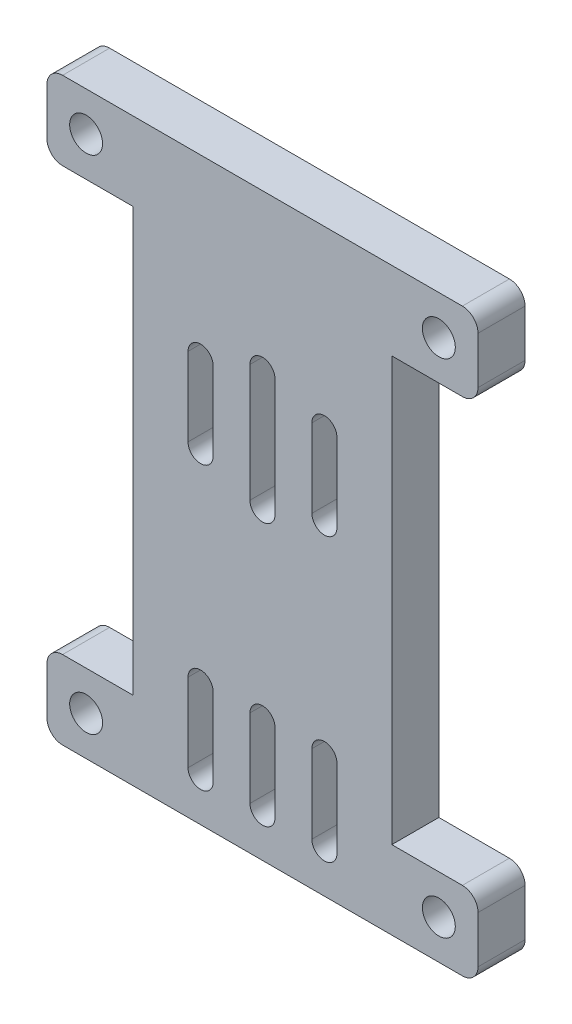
ISO-10303-21;
HEADER;
FILE_DESCRIPTION(('STEP AP214'),'2;1');
FILE_NAME('part.step','',(''),(''),'','','');
FILE_SCHEMA(('AUTOMOTIVE_DESIGN { 1 0 10303 214 1 1 1 1 }'));
ENDSEC;
DATA;
#1=APPLICATION_CONTEXT('core data for automotive mechanical design processes');
#2=APPLICATION_PROTOCOL_DEFINITION('international standard','automotive_design',2000,#1);
#3=PRODUCT_CONTEXT('',#1,'mechanical');
#4=PRODUCT('Part','Part','',(#3));
#5=PRODUCT_RELATED_PRODUCT_CATEGORY('part','',(#4));
#6=PRODUCT_DEFINITION_FORMATION('','',#4);
#7=PRODUCT_DEFINITION_CONTEXT('part definition',#1,'design');
#8=PRODUCT_DEFINITION('design','',#6,#7);
#9=PRODUCT_DEFINITION_SHAPE('','',#8);
#10=(LENGTH_UNIT() NAMED_UNIT(*) SI_UNIT(.MILLI.,.METRE.));
#11=(NAMED_UNIT(*) PLANE_ANGLE_UNIT() SI_UNIT($,.RADIAN.));
#12=(NAMED_UNIT(*) SI_UNIT($,.STERADIAN.) SOLID_ANGLE_UNIT());
#13=UNCERTAINTY_MEASURE_WITH_UNIT(LENGTH_MEASURE(1.E-05),#10,'distance_accuracy_value','');
#14=(GEOMETRIC_REPRESENTATION_CONTEXT(3) GLOBAL_UNCERTAINTY_ASSIGNED_CONTEXT((#13)) GLOBAL_UNIT_ASSIGNED_CONTEXT((#10,
#11,#12)) REPRESENTATION_CONTEXT('',''));
#15=CARTESIAN_POINT('',(0.,0.,0.));
#16=DIRECTION('',(0.,0.,1.));
#17=DIRECTION('',(1.,0.,0.));
#18=AXIS2_PLACEMENT_3D('',#15,#16,#17);
#19=CARTESIAN_POINT('',(0.,0.,6.));
#20=DIRECTION('',(1.,0.,0.));
#21=DIRECTION('',(0.,0.,-1.));
#22=AXIS2_PLACEMENT_3D('',#19,#20,#21);
#23=PLANE('',#22);
#24=DIRECTION('',(0.,0.,1.));
#25=VECTOR('',#24,1.);
#26=CARTESIAN_POINT('',(0.,7.5,-55.9016994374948));
#27=LINE('',#26,#25);
#28=CARTESIAN_POINT('',(0.,7.5,0.));
#29=VERTEX_POINT('',#28);
#30=CARTESIAN_POINT('',(0.,7.5,6.));
#31=VERTEX_POINT('',#30);
#32=EDGE_CURVE('E58',#29,#31,#27,.T.);
#33=ORIENTED_EDGE('',*,*,#32,.T.);
#34=DIRECTION('',(0.,-1.,0.));
#35=VECTOR('',#34,1.);
#36=CARTESIAN_POINT('',(0.,0.,6.));
#37=LINE('',#36,#35);
#38=CARTESIAN_POINT('',(0.,61.5,6.));
#39=VERTEX_POINT('',#38);
#40=EDGE_CURVE('E45',#39,#31,#37,.T.);
#41=ORIENTED_EDGE('',*,*,#40,.F.);
#42=DIRECTION('',(0.,0.,1.));
#43=VECTOR('',#42,1.);
#44=CARTESIAN_POINT('',(0.,61.5,-55.9016994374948));
#45=LINE('',#44,#43);
#46=CARTESIAN_POINT('',(0.,61.5,0.));
#47=VERTEX_POINT('',#46);
#48=EDGE_CURVE('E415',#47,#39,#45,.T.);
#49=ORIENTED_EDGE('',*,*,#48,.F.);
#50=DIRECTION('',(0.,-1.,0.));
#51=VECTOR('',#50,1.);
#52=CARTESIAN_POINT('',(0.,0.,0.));
#53=LINE('',#52,#51);
#54=EDGE_CURVE('E53',#47,#29,#53,.T.);
#55=ORIENTED_EDGE('',*,*,#54,.T.);
#56=EDGE_LOOP('',(#33,#41,#49,#55));
#57=FACE_BOUND('',#56,.T.);
#58=ADVANCED_FACE('F37',(#57),#23,.F.);
#59=CARTESIAN_POINT('',(33.,0.,6.));
#60=DIRECTION('',(-1.,0.,0.));
#61=DIRECTION('',(0.,-1.,0.));
#62=AXIS2_PLACEMENT_3D('',#59,#60,#61);
#63=PLANE('',#62);
#64=DIRECTION('',(0.,0.,1.));
#65=VECTOR('',#64,1.);
#66=CARTESIAN_POINT('',(33.,7.5,-55.9016994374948));
#67=LINE('',#66,#65);
#68=CARTESIAN_POINT('',(33.,7.5,0.));
#69=VERTEX_POINT('',#68);
#70=CARTESIAN_POINT('',(33.,7.5,6.));
#71=VERTEX_POINT('',#70);
#72=EDGE_CURVE('E628',#69,#71,#67,.T.);
#73=ORIENTED_EDGE('',*,*,#72,.F.);
#74=DIRECTION('',(0.,1.,0.));
#75=VECTOR('',#74,1.);
#76=CARTESIAN_POINT('',(33.,0.,0.));
#77=LINE('',#76,#75);
#78=CARTESIAN_POINT('',(33.,61.5,0.));
#79=VERTEX_POINT('',#78);
#80=EDGE_CURVE('E40',#69,#79,#77,.T.);
#81=ORIENTED_EDGE('',*,*,#80,.T.);
#82=DIRECTION('',(0.,0.,1.));
#83=VECTOR('',#82,1.);
#84=CARTESIAN_POINT('',(33.,61.5,-55.9016994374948));
#85=LINE('',#84,#83);
#86=CARTESIAN_POINT('',(33.,61.5,6.));
#87=VERTEX_POINT('',#86);
#88=EDGE_CURVE('E412',#79,#87,#85,.T.);
#89=ORIENTED_EDGE('',*,*,#88,.T.);
#90=DIRECTION('',(0.,1.,0.));
#91=VECTOR('',#90,1.);
#92=CARTESIAN_POINT('',(33.,0.,6.));
#93=LINE('',#92,#91);
#94=EDGE_CURVE('E11',#71,#87,#93,.T.);
#95=ORIENTED_EDGE('',*,*,#94,.F.);
#96=EDGE_LOOP('',(#73,#81,#89,#95));
#97=FACE_BOUND('',#96,.T.);
#98=ADVANCED_FACE('F624',(#97),#63,.F.);
#99=CARTESIAN_POINT('',(0.,0.,6.));
#100=DIRECTION('',(0.,0.,-1.));
#101=DIRECTION('',(-1.,0.,0.));
#102=AXIS2_PLACEMENT_3D('',#99,#100,#101);
#103=PLANE('',#102);
#104=DIRECTION('',(1.,0.,0.));
#105=VECTOR('',#104,1.);
#106=CARTESIAN_POINT('',(0.,61.5,6.));
#107=LINE('',#106,#105);
#108=CARTESIAN_POINT('',(-9.00000000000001,61.5,6.));
#109=VERTEX_POINT('',#108);
#110=EDGE_CURVE('E391',#109,#39,#107,.T.);
#111=ORIENTED_EDGE('',*,*,#110,.T.);
#112=ORIENTED_EDGE('',*,*,#40,.T.);
#113=DIRECTION('',(1.,0.,0.));
#114=VECTOR('',#113,1.);
#115=CARTESIAN_POINT('',(0.,7.5,6.));
#116=LINE('',#115,#114);
#117=CARTESIAN_POINT('',(-9.00000000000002,7.5,6.));
#118=VERTEX_POINT('',#117);
#119=EDGE_CURVE('E348',#118,#31,#116,.T.);
#120=ORIENTED_EDGE('',*,*,#119,.F.);
#121=CARTESIAN_POINT('',(-9.00000000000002,5.5,6.));
#122=DIRECTION('',(0.,0.,1.));
#123=DIRECTION('',(1.,0.,0.));
#124=AXIS2_PLACEMENT_3D('',#121,#122,#123);
#125=CIRCLE('',#124,2.);
#126=CARTESIAN_POINT('',(-11.,5.5,6.));
#127=VERTEX_POINT('',#126);
#128=EDGE_CURVE('E339',#118,#127,#125,.T.);
#129=ORIENTED_EDGE('',*,*,#128,.T.);
#130=DIRECTION('',(0.,-1.,0.));
#131=VECTOR('',#130,1.);
#132=CARTESIAN_POINT('',(-11.,0.,6.));
#133=LINE('',#132,#131);
#134=CARTESIAN_POINT('',(-11.,-0.499999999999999,6.));
#135=VERTEX_POINT('',#134);
#136=EDGE_CURVE('E663',#127,#135,#133,.T.);
#137=ORIENTED_EDGE('',*,*,#136,.T.);
#138=CARTESIAN_POINT('',(-9.00000000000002,-0.499999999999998,6.));
#139=DIRECTION('',(0.,0.,1.));
#140=DIRECTION('',(1.,0.,0.));
#141=AXIS2_PLACEMENT_3D('',#138,#139,#140);
#142=CIRCLE('',#141,2.);
#143=CARTESIAN_POINT('',(-9.00000000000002,-2.5,6.));
#144=VERTEX_POINT('',#143);
#145=EDGE_CURVE('E667',#135,#144,#142,.T.);
#146=ORIENTED_EDGE('',*,*,#145,.T.);
#147=DIRECTION('',(1.,0.,0.));
#148=VECTOR('',#147,1.);
#149=CARTESIAN_POINT('',(0.,-2.5,6.));
#150=LINE('',#149,#148);
#151=CARTESIAN_POINT('',(42.,-2.5,6.));
#152=VERTEX_POINT('',#151);
#153=EDGE_CURVE('E672',#144,#152,#150,.T.);
#154=ORIENTED_EDGE('',*,*,#153,.T.);
#155=CARTESIAN_POINT('',(42.,-0.499999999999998,6.));
#156=DIRECTION('',(0.,0.,1.));
#157=DIRECTION('',(1.,0.,0.));
#158=AXIS2_PLACEMENT_3D('',#155,#156,#157);
#159=CIRCLE('',#158,2.);
#160=CARTESIAN_POINT('',(44.,-0.499999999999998,6.));
#161=VERTEX_POINT('',#160);
#162=EDGE_CURVE('E678',#152,#161,#159,.T.);
#163=ORIENTED_EDGE('',*,*,#162,.T.);
#164=DIRECTION('',(0.,-1.,0.));
#165=VECTOR('',#164,1.);
#166=CARTESIAN_POINT('',(44.,0.,6.));
#167=LINE('',#166,#165);
#168=CARTESIAN_POINT('',(44.,5.5,6.));
#169=VERTEX_POINT('',#168);
#170=EDGE_CURVE('E681',#169,#161,#167,.T.);
#171=ORIENTED_EDGE('',*,*,#170,.F.);
#172=CARTESIAN_POINT('',(42.,5.5,6.));
#173=DIRECTION('',(0.,0.,1.));
#174=DIRECTION('',(1.,0.,0.));
#175=AXIS2_PLACEMENT_3D('',#172,#173,#174);
#176=CIRCLE('',#175,2.);
#177=CARTESIAN_POINT('',(42.,7.5,6.));
#178=VERTEX_POINT('',#177);
#179=EDGE_CURVE('E346',#178,#169,#176,.F.);
#180=ORIENTED_EDGE('',*,*,#179,.F.);
#181=EDGE_CURVE('E341',#71,#178,#116,.T.);
#182=ORIENTED_EDGE('',*,*,#181,.F.);
#183=ORIENTED_EDGE('',*,*,#94,.T.);
#184=CARTESIAN_POINT('',(42.,61.5,6.));
#185=VERTEX_POINT('',#184);
#186=EDGE_CURVE('E387',#87,#185,#107,.T.);
#187=ORIENTED_EDGE('',*,*,#186,.T.);
#188=CARTESIAN_POINT('',(42.,63.5,6.));
#189=DIRECTION('',(0.,0.,1.));
#190=DIRECTION('',(1.,0.,0.));
#191=AXIS2_PLACEMENT_3D('',#188,#189,#190);
#192=CIRCLE('',#191,2.);
#193=CARTESIAN_POINT('',(44.,63.5,6.));
#194=VERTEX_POINT('',#193);
#195=EDGE_CURVE('E390',#185,#194,#192,.T.);
#196=ORIENTED_EDGE('',*,*,#195,.T.);
#197=DIRECTION('',(0.,-1.,0.));
#198=VECTOR('',#197,1.);
#199=CARTESIAN_POINT('',(44.,0.,6.));
#200=LINE('',#199,#198);
#201=CARTESIAN_POINT('',(44.,69.5,6.));
#202=VERTEX_POINT('',#201);
#203=EDGE_CURVE('E394',#202,#194,#200,.T.);
#204=ORIENTED_EDGE('',*,*,#203,.F.);
#205=CARTESIAN_POINT('',(42.,69.5,6.));
#206=DIRECTION('',(0.,0.,1.));
#207=DIRECTION('',(1.,0.,0.));
#208=AXIS2_PLACEMENT_3D('',#205,#206,#207);
#209=CIRCLE('',#208,2.);
#210=CARTESIAN_POINT('',(42.,71.5,6.));
#211=VERTEX_POINT('',#210);
#212=EDGE_CURVE('E397',#211,#202,#209,.F.);
#213=ORIENTED_EDGE('',*,*,#212,.F.);
#214=DIRECTION('',(1.,0.,0.));
#215=VECTOR('',#214,1.);
#216=CARTESIAN_POINT('',(0.,71.5,6.));
#217=LINE('',#216,#215);
#218=CARTESIAN_POINT('',(-9.00000000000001,71.5,6.));
#219=VERTEX_POINT('',#218);
#220=EDGE_CURVE('E400',#219,#211,#217,.T.);
#221=ORIENTED_EDGE('',*,*,#220,.F.);
#222=CARTESIAN_POINT('',(-9.00000000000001,69.5,6.));
#223=DIRECTION('',(0.,0.,1.));
#224=DIRECTION('',(1.,0.,0.));
#225=AXIS2_PLACEMENT_3D('',#222,#223,#224);
#226=CIRCLE('',#225,2.);
#227=CARTESIAN_POINT('',(-11.,69.5,6.));
#228=VERTEX_POINT('',#227);
#229=EDGE_CURVE('E403',#219,#228,#226,.T.);
#230=ORIENTED_EDGE('',*,*,#229,.T.);
#231=DIRECTION('',(0.,-1.,0.));
#232=VECTOR('',#231,1.);
#233=CARTESIAN_POINT('',(-11.,0.,6.));
#234=LINE('',#233,#232);
#235=CARTESIAN_POINT('',(-11.,63.5,6.));
#236=VERTEX_POINT('',#235);
#237=EDGE_CURVE('E406',#228,#236,#234,.T.);
#238=ORIENTED_EDGE('',*,*,#237,.T.);
#239=CARTESIAN_POINT('',(-9.00000000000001,63.5,6.));
#240=DIRECTION('',(0.,0.,1.));
#241=DIRECTION('',(1.,0.,0.));
#242=AXIS2_PLACEMENT_3D('',#239,#240,#241);
#243=CIRCLE('',#242,1.99999999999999);
#244=EDGE_CURVE('E409',#236,#109,#243,.T.);
#245=ORIENTED_EDGE('',*,*,#244,.T.);
#246=EDGE_LOOP('',(#111,#112,#120,#129,#137,#146,#154,#163,#171,#180,#182,#183,#187,#196,#204,
#213,#221,#230,#238,#245));
#247=FACE_BOUND('',#246,.T.);
#248=CARTESIAN_POINT('',(8.6,13.,6.));
#249=DIRECTION('',(0.,0.,1.));
#250=DIRECTION('',(1.,0.,0.));
#251=AXIS2_PLACEMENT_3D('',#248,#249,#250);
#252=CIRCLE('',#251,1.6);
#253=CARTESIAN_POINT('',(10.2,13.,6.));
#254=VERTEX_POINT('',#253);
#255=CARTESIAN_POINT('',(7.,13.,6.));
#256=VERTEX_POINT('',#255);
#257=EDGE_CURVE('E467',#254,#256,#252,.T.);
#258=ORIENTED_EDGE('',*,*,#257,.F.);
#259=DIRECTION('',(0.,1.,0.));
#260=VECTOR('',#259,1.);
#261=CARTESIAN_POINT('',(10.2,13.,6.));
#262=LINE('',#261,#260);
#263=CARTESIAN_POINT('',(10.2,3.,6.));
#264=VERTEX_POINT('',#263);
#265=EDGE_CURVE('E475',#264,#254,#262,.T.);
#266=ORIENTED_EDGE('',*,*,#265,.F.);
#267=CARTESIAN_POINT('',(8.6,3.,6.));
#268=DIRECTION('',(0.,0.,1.));
#269=DIRECTION('',(1.,0.,0.));
#270=AXIS2_PLACEMENT_3D('',#267,#268,#269);
#271=CIRCLE('',#270,1.6);
#272=CARTESIAN_POINT('',(7.,3.,6.));
#273=VERTEX_POINT('',#272);
#274=EDGE_CURVE('E472',#273,#264,#271,.T.);
#275=ORIENTED_EDGE('',*,*,#274,.F.);
#276=DIRECTION('',(0.,-1.,0.));
#277=VECTOR('',#276,1.);
#278=CARTESIAN_POINT('',(7.,13.,6.));
#279=LINE('',#278,#277);
#280=EDGE_CURVE('E469',#256,#273,#279,.T.);
#281=ORIENTED_EDGE('',*,*,#280,.F.);
#282=EDGE_LOOP('',(#258,#266,#275,#281));
#283=FACE_BOUND('',#282,.T.);
#284=CARTESIAN_POINT('',(24.4,49.,6.));
#285=DIRECTION('',(0.,0.,1.));
#286=DIRECTION('',(1.,0.,0.));
#287=AXIS2_PLACEMENT_3D('',#284,#285,#286);
#288=CIRCLE('',#287,1.6);
#289=CARTESIAN_POINT('',(26.,49.,6.));
#290=VERTEX_POINT('',#289);
#291=CARTESIAN_POINT('',(22.8,49.,6.));
#292=VERTEX_POINT('',#291);
#293=EDGE_CURVE('E529',#290,#292,#288,.T.);
#294=ORIENTED_EDGE('',*,*,#293,.F.);
#295=DIRECTION('',(0.,1.,0.));
#296=VECTOR('',#295,1.);
#297=CARTESIAN_POINT('',(26.,49.,6.));
#298=LINE('',#297,#296);
#299=CARTESIAN_POINT('',(26.,39.,6.));
#300=VERTEX_POINT('',#299);
#301=EDGE_CURVE('E537',#300,#290,#298,.T.);
#302=ORIENTED_EDGE('',*,*,#301,.F.);
#303=CARTESIAN_POINT('',(24.4,39.,6.));
#304=DIRECTION('',(0.,0.,1.));
#305=DIRECTION('',(1.,0.,0.));
#306=AXIS2_PLACEMENT_3D('',#303,#304,#305);
#307=CIRCLE('',#306,1.6);
#308=CARTESIAN_POINT('',(22.8,39.,6.));
#309=VERTEX_POINT('',#308);
#310=EDGE_CURVE('E534',#309,#300,#307,.T.);
#311=ORIENTED_EDGE('',*,*,#310,.F.);
#312=DIRECTION('',(0.,-1.,0.));
#313=VECTOR('',#312,1.);
#314=CARTESIAN_POINT('',(22.8,49.,6.));
#315=LINE('',#314,#313);
#316=EDGE_CURVE('E531',#292,#309,#315,.T.);
#317=ORIENTED_EDGE('',*,*,#316,.F.);
#318=EDGE_LOOP('',(#294,#302,#311,#317));
#319=FACE_BOUND('',#318,.T.);
#320=CARTESIAN_POINT('',(8.59999999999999,49.,6.));
#321=DIRECTION('',(0.,0.,1.));
#322=DIRECTION('',(1.,0.,0.));
#323=AXIS2_PLACEMENT_3D('',#320,#321,#322);
#324=CIRCLE('',#323,1.6);
#325=CARTESIAN_POINT('',(10.2,49.,6.));
#326=VERTEX_POINT('',#325);
#327=CARTESIAN_POINT('',(7.,49.,6.));
#328=VERTEX_POINT('',#327);
#329=EDGE_CURVE('E591',#326,#328,#324,.T.);
#330=ORIENTED_EDGE('',*,*,#329,.F.);
#331=DIRECTION('',(0.,1.,0.));
#332=VECTOR('',#331,1.);
#333=CARTESIAN_POINT('',(10.2,49.,6.));
#334=LINE('',#333,#332);
#335=CARTESIAN_POINT('',(10.2,39.,6.));
#336=VERTEX_POINT('',#335);
#337=EDGE_CURVE('E599',#336,#326,#334,.T.);
#338=ORIENTED_EDGE('',*,*,#337,.F.);
#339=CARTESIAN_POINT('',(8.59999999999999,39.,6.));
#340=DIRECTION('',(0.,0.,1.));
#341=DIRECTION('',(1.,0.,0.));
#342=AXIS2_PLACEMENT_3D('',#339,#340,#341);
#343=CIRCLE('',#342,1.6);
#344=CARTESIAN_POINT('',(6.99999999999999,39.,6.));
#345=VERTEX_POINT('',#344);
#346=EDGE_CURVE('E596',#345,#336,#343,.T.);
#347=ORIENTED_EDGE('',*,*,#346,.F.);
#348=DIRECTION('',(0.,-1.,0.));
#349=VECTOR('',#348,1.);
#350=CARTESIAN_POINT('',(7.,49.,6.));
#351=LINE('',#350,#349);
#352=EDGE_CURVE('E593',#328,#345,#351,.T.);
#353=ORIENTED_EDGE('',*,*,#352,.F.);
#354=EDGE_LOOP('',(#330,#338,#347,#353));
#355=FACE_BOUND('',#354,.T.);
#356=CARTESIAN_POINT('',(16.5,51.5,6.));
#357=DIRECTION('',(0.,0.,1.));
#358=DIRECTION('',(1.,0.,0.));
#359=AXIS2_PLACEMENT_3D('',#356,#357,#358);
#360=CIRCLE('',#359,1.6);
#361=CARTESIAN_POINT('',(18.1,51.5,6.));
#362=VERTEX_POINT('',#361);
#363=CARTESIAN_POINT('',(14.9,51.5,6.));
#364=VERTEX_POINT('',#363);
#365=EDGE_CURVE('E560',#362,#364,#360,.T.);
#366=ORIENTED_EDGE('',*,*,#365,.F.);
#367=DIRECTION('',(0.,1.,0.));
#368=VECTOR('',#367,1.);
#369=CARTESIAN_POINT('',(18.1,51.5,6.));
#370=LINE('',#369,#368);
#371=CARTESIAN_POINT('',(18.1,36.5,6.));
#372=VERTEX_POINT('',#371);
#373=EDGE_CURVE('E568',#372,#362,#370,.T.);
#374=ORIENTED_EDGE('',*,*,#373,.F.);
#375=CARTESIAN_POINT('',(16.5,36.5,6.));
#376=DIRECTION('',(0.,0.,1.));
#377=DIRECTION('',(1.,0.,0.));
#378=AXIS2_PLACEMENT_3D('',#375,#376,#377);
#379=CIRCLE('',#378,1.6);
#380=CARTESIAN_POINT('',(14.9,36.5,6.));
#381=VERTEX_POINT('',#380);
#382=EDGE_CURVE('E565',#381,#372,#379,.T.);
#383=ORIENTED_EDGE('',*,*,#382,.F.);
#384=DIRECTION('',(0.,-1.,0.));
#385=VECTOR('',#384,1.);
#386=CARTESIAN_POINT('',(14.9,51.5,6.));
#387=LINE('',#386,#385);
#388=EDGE_CURVE('E562',#364,#381,#387,.T.);
#389=ORIENTED_EDGE('',*,*,#388,.F.);
#390=EDGE_LOOP('',(#366,#374,#383,#389));
#391=FACE_BOUND('',#390,.T.);
#392=CARTESIAN_POINT('',(16.5,13.,6.));
#393=DIRECTION('',(0.,0.,1.));
#394=DIRECTION('',(1.,0.,0.));
#395=AXIS2_PLACEMENT_3D('',#392,#393,#394);
#396=CIRCLE('',#395,1.6);
#397=CARTESIAN_POINT('',(18.1,13.,6.));
#398=VERTEX_POINT('',#397);
#399=CARTESIAN_POINT('',(14.9,13.,6.));
#400=VERTEX_POINT('',#399);
#401=EDGE_CURVE('E498',#398,#400,#396,.T.);
#402=ORIENTED_EDGE('',*,*,#401,.F.);
#403=DIRECTION('',(0.,1.,0.));
#404=VECTOR('',#403,1.);
#405=CARTESIAN_POINT('',(18.1,13.,6.));
#406=LINE('',#405,#404);
#407=CARTESIAN_POINT('',(18.1,3.,6.));
#408=VERTEX_POINT('',#407);
#409=EDGE_CURVE('E506',#408,#398,#406,.T.);
#410=ORIENTED_EDGE('',*,*,#409,.F.);
#411=CARTESIAN_POINT('',(16.5,3.,6.));
#412=DIRECTION('',(0.,0.,1.));
#413=DIRECTION('',(1.,0.,0.));
#414=AXIS2_PLACEMENT_3D('',#411,#412,#413);
#415=CIRCLE('',#414,1.6);
#416=CARTESIAN_POINT('',(14.9,3.,6.));
#417=VERTEX_POINT('',#416);
#418=EDGE_CURVE('E503',#417,#408,#415,.T.);
#419=ORIENTED_EDGE('',*,*,#418,.F.);
#420=DIRECTION('',(0.,-1.,0.));
#421=VECTOR('',#420,1.);
#422=CARTESIAN_POINT('',(14.9,13.,6.));
#423=LINE('',#422,#421);
#424=EDGE_CURVE('E500',#400,#417,#423,.T.);
#425=ORIENTED_EDGE('',*,*,#424,.F.);
#426=EDGE_LOOP('',(#402,#410,#419,#425));
#427=FACE_BOUND('',#426,.T.);
#428=CARTESIAN_POINT('',(24.4,13.,6.));
#429=DIRECTION('',(0.,0.,1.));
#430=DIRECTION('',(1.,0.,0.));
#431=AXIS2_PLACEMENT_3D('',#428,#429,#430);
#432=CIRCLE('',#431,1.6);
#433=CARTESIAN_POINT('',(26.,13.,6.));
#434=VERTEX_POINT('',#433);
#435=CARTESIAN_POINT('',(22.8,13.,6.));
#436=VERTEX_POINT('',#435);
#437=EDGE_CURVE('E436',#434,#436,#432,.T.);
#438=ORIENTED_EDGE('',*,*,#437,.F.);
#439=DIRECTION('',(0.,1.,0.));
#440=VECTOR('',#439,1.);
#441=CARTESIAN_POINT('',(26.,13.,6.));
#442=LINE('',#441,#440);
#443=CARTESIAN_POINT('',(26.,3.,6.));
#444=VERTEX_POINT('',#443);
#445=EDGE_CURVE('E444',#444,#434,#442,.T.);
#446=ORIENTED_EDGE('',*,*,#445,.F.);
#447=CARTESIAN_POINT('',(24.4,3.,6.));
#448=DIRECTION('',(0.,0.,1.));
#449=DIRECTION('',(1.,0.,0.));
#450=AXIS2_PLACEMENT_3D('',#447,#448,#449);
#451=CIRCLE('',#450,1.6);
#452=CARTESIAN_POINT('',(22.8,3.,6.));
#453=VERTEX_POINT('',#452);
#454=EDGE_CURVE('E441',#453,#444,#451,.T.);
#455=ORIENTED_EDGE('',*,*,#454,.F.);
#456=DIRECTION('',(0.,-1.,0.));
#457=VECTOR('',#456,1.);
#458=CARTESIAN_POINT('',(22.8,13.,6.));
#459=LINE('',#458,#457);
#460=EDGE_CURVE('E438',#436,#453,#459,.T.);
#461=ORIENTED_EDGE('',*,*,#460,.F.);
#462=EDGE_LOOP('',(#438,#446,#455,#461));
#463=FACE_BOUND('',#462,.T.);
#464=CARTESIAN_POINT('',(-6.00000000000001,66.5,6.));
#465=DIRECTION('',(0.,0.,1.));
#466=DIRECTION('',(1.,0.,0.));
#467=AXIS2_PLACEMENT_3D('',#464,#465,#466);
#468=CIRCLE('',#467,2.1);
#469=CARTESIAN_POINT('',(-3.90000000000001,66.5,6.));
#470=VERTEX_POINT('',#469);
#471=EDGE_CURVE('E373',#470,#470,#468,.T.);
#472=ORIENTED_EDGE('',*,*,#471,.F.);
#473=EDGE_LOOP('',(#472));
#474=FACE_BOUND('',#473,.T.);
#475=CARTESIAN_POINT('',(39.,66.5,6.));
#476=DIRECTION('',(0.,0.,1.));
#477=DIRECTION('',(1.,0.,0.));
#478=AXIS2_PLACEMENT_3D('',#475,#476,#477);
#479=CIRCLE('',#478,2.1);
#480=CARTESIAN_POINT('',(41.1,66.5,6.));
#481=VERTEX_POINT('',#480);
#482=EDGE_CURVE('E384',#481,#481,#479,.T.);
#483=ORIENTED_EDGE('',*,*,#482,.F.);
#484=EDGE_LOOP('',(#483));
#485=FACE_BOUND('',#484,.T.);
#486=CARTESIAN_POINT('',(-6.00000000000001,2.5,6.));
#487=DIRECTION('',(0.,0.,1.));
#488=DIRECTION('',(1.,0.,0.));
#489=AXIS2_PLACEMENT_3D('',#486,#487,#488);
#490=CIRCLE('',#489,2.1);
#491=CARTESIAN_POINT('',(-3.90000000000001,2.5,6.));
#492=VERTEX_POINT('',#491);
#493=EDGE_CURVE('E333',#492,#492,#490,.T.);
#494=ORIENTED_EDGE('',*,*,#493,.F.);
#495=EDGE_LOOP('',(#494));
#496=FACE_BOUND('',#495,.T.);
#497=CARTESIAN_POINT('',(39.,2.49999999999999,6.));
#498=DIRECTION('',(0.,0.,1.));
#499=DIRECTION('',(1.,0.,0.));
#500=AXIS2_PLACEMENT_3D('',#497,#498,#499);
#501=CIRCLE('',#500,2.1);
#502=CARTESIAN_POINT('',(41.1,2.49999999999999,6.));
#503=VERTEX_POINT('',#502);
#504=EDGE_CURVE('E711',#503,#503,#501,.T.);
#505=ORIENTED_EDGE('',*,*,#504,.F.);
#506=EDGE_LOOP('',(#505));
#507=FACE_BOUND('',#506,.T.);
#508=ADVANCED_FACE('F636',(#247,#283,#319,#355,#391,#427,#463,#474,#485,#496,#507),#103,.F.);
#509=CARTESIAN_POINT('',(0.,0.,0.));
#510=DIRECTION('',(0.,0.,-1.));
#511=DIRECTION('',(-1.,0.,0.));
#512=AXIS2_PLACEMENT_3D('',#509,#510,#511);
#513=PLANE('',#512);
#514=ORIENTED_EDGE('',*,*,#54,.F.);
#515=DIRECTION('',(1.,0.,0.));
#516=VECTOR('',#515,1.);
#517=CARTESIAN_POINT('',(0.,61.5,0.));
#518=LINE('',#517,#516);
#519=CARTESIAN_POINT('',(-9.00000000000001,61.5,0.));
#520=VERTEX_POINT('',#519);
#521=EDGE_CURVE('E367',#520,#47,#518,.T.);
#522=ORIENTED_EDGE('',*,*,#521,.F.);
#523=CARTESIAN_POINT('',(-9.00000000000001,63.5,0.));
#524=DIRECTION('',(0.,0.,-1.));
#525=DIRECTION('',(-1.,0.,0.));
#526=AXIS2_PLACEMENT_3D('',#523,#524,#525);
#527=CIRCLE('',#526,1.99999999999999);
#528=CARTESIAN_POINT('',(-11.,63.5,0.));
#529=VERTEX_POINT('',#528);
#530=EDGE_CURVE('E364',#529,#520,#527,.F.);
#531=ORIENTED_EDGE('',*,*,#530,.F.);
#532=DIRECTION('',(0.,-1.,0.));
#533=VECTOR('',#532,1.);
#534=CARTESIAN_POINT('',(-11.,0.,0.));
#535=LINE('',#534,#533);
#536=CARTESIAN_POINT('',(-11.,69.5,0.));
#537=VERTEX_POINT('',#536);
#538=EDGE_CURVE('E361',#537,#529,#535,.T.);
#539=ORIENTED_EDGE('',*,*,#538,.F.);
#540=CARTESIAN_POINT('',(-9.00000000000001,69.5,0.));
#541=DIRECTION('',(0.,0.,-1.));
#542=DIRECTION('',(-1.,0.,0.));
#543=AXIS2_PLACEMENT_3D('',#540,#541,#542);
#544=CIRCLE('',#543,2.);
#545=CARTESIAN_POINT('',(-9.00000000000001,71.5,0.));
#546=VERTEX_POINT('',#545);
#547=EDGE_CURVE('E358',#546,#537,#544,.F.);
#548=ORIENTED_EDGE('',*,*,#547,.F.);
#549=DIRECTION('',(1.,0.,0.));
#550=VECTOR('',#549,1.);
#551=CARTESIAN_POINT('',(0.,71.5,0.));
#552=LINE('',#551,#550);
#553=CARTESIAN_POINT('',(42.,71.5,0.));
#554=VERTEX_POINT('',#553);
#555=EDGE_CURVE('E356',#546,#554,#552,.T.);
#556=ORIENTED_EDGE('',*,*,#555,.T.);
#557=CARTESIAN_POINT('',(42.,69.5,0.));
#558=DIRECTION('',(0.,0.,-1.));
#559=DIRECTION('',(-1.,0.,0.));
#560=AXIS2_PLACEMENT_3D('',#557,#558,#559);
#561=CIRCLE('',#560,2.);
#562=CARTESIAN_POINT('',(44.,69.5,0.));
#563=VERTEX_POINT('',#562);
#564=EDGE_CURVE('E353',#554,#563,#561,.T.);
#565=ORIENTED_EDGE('',*,*,#564,.T.);
#566=DIRECTION('',(0.,-1.,0.));
#567=VECTOR('',#566,1.);
#568=CARTESIAN_POINT('',(44.,0.,0.));
#569=LINE('',#568,#567);
#570=CARTESIAN_POINT('',(44.,63.5,0.));
#571=VERTEX_POINT('',#570);
#572=EDGE_CURVE('E351',#563,#571,#569,.T.);
#573=ORIENTED_EDGE('',*,*,#572,.T.);
#574=CARTESIAN_POINT('',(42.,63.5,0.));
#575=DIRECTION('',(0.,0.,-1.));
#576=DIRECTION('',(-1.,0.,0.));
#577=AXIS2_PLACEMENT_3D('',#574,#575,#576);
#578=CIRCLE('',#577,2.);
#579=CARTESIAN_POINT('',(42.,61.5,0.));
#580=VERTEX_POINT('',#579);
#581=EDGE_CURVE('E378',#580,#571,#578,.F.);
#582=ORIENTED_EDGE('',*,*,#581,.F.);
#583=DIRECTION('',(1.,0.,0.));
#584=VECTOR('',#583,1.);
#585=CARTESIAN_POINT('',(0.,61.5,0.));
#586=LINE('',#585,#584);
#587=EDGE_CURVE('E370',#79,#580,#586,.T.);
#588=ORIENTED_EDGE('',*,*,#587,.F.);
#589=ORIENTED_EDGE('',*,*,#80,.F.);
#590=DIRECTION('',(1.,0.,0.));
#591=VECTOR('',#590,1.);
#592=CARTESIAN_POINT('',(0.,7.5,0.));
#593=LINE('',#592,#591);
#594=CARTESIAN_POINT('',(42.,7.5,0.));
#595=VERTEX_POINT('',#594);
#596=EDGE_CURVE('E334',#69,#595,#593,.T.);
#597=ORIENTED_EDGE('',*,*,#596,.T.);
#598=CARTESIAN_POINT('',(42.,5.5,0.));
#599=DIRECTION('',(0.,0.,-1.));
#600=DIRECTION('',(-1.,0.,0.));
#601=AXIS2_PLACEMENT_3D('',#598,#599,#600);
#602=CIRCLE('',#601,2.);
#603=CARTESIAN_POINT('',(44.,5.5,0.));
#604=VERTEX_POINT('',#603);
#605=EDGE_CURVE('E696',#595,#604,#602,.T.);
#606=ORIENTED_EDGE('',*,*,#605,.T.);
#607=DIRECTION('',(0.,-1.,0.));
#608=VECTOR('',#607,1.);
#609=CARTESIAN_POINT('',(44.,0.,0.));
#610=LINE('',#609,#608);
#611=CARTESIAN_POINT('',(44.,-0.499999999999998,0.));
#612=VERTEX_POINT('',#611);
#613=EDGE_CURVE('E695',#604,#612,#610,.T.);
#614=ORIENTED_EDGE('',*,*,#613,.T.);
#615=CARTESIAN_POINT('',(42.,-0.499999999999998,0.));
#616=DIRECTION('',(0.,0.,-1.));
#617=DIRECTION('',(-1.,0.,0.));
#618=AXIS2_PLACEMENT_3D('',#615,#616,#617);
#619=CIRCLE('',#618,2.);
#620=CARTESIAN_POINT('',(42.,-2.5,0.));
#621=VERTEX_POINT('',#620);
#622=EDGE_CURVE('E697',#621,#612,#619,.F.);
#623=ORIENTED_EDGE('',*,*,#622,.F.);
#624=DIRECTION('',(1.,0.,0.));
#625=VECTOR('',#624,1.);
#626=CARTESIAN_POINT('',(0.,-2.5,0.));
#627=LINE('',#626,#625);
#628=CARTESIAN_POINT('',(-9.00000000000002,-2.5,0.));
#629=VERTEX_POINT('',#628);
#630=EDGE_CURVE('E700',#629,#621,#627,.T.);
#631=ORIENTED_EDGE('',*,*,#630,.F.);
#632=CARTESIAN_POINT('',(-9.00000000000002,-0.499999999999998,0.));
#633=DIRECTION('',(0.,0.,-1.));
#634=DIRECTION('',(-1.,0.,0.));
#635=AXIS2_PLACEMENT_3D('',#632,#633,#634);
#636=CIRCLE('',#635,2.);
#637=CARTESIAN_POINT('',(-11.,-0.499999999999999,0.));
#638=VERTEX_POINT('',#637);
#639=EDGE_CURVE('E1018',#638,#629,#636,.F.);
#640=ORIENTED_EDGE('',*,*,#639,.F.);
#641=DIRECTION('',(0.,-1.,0.));
#642=VECTOR('',#641,1.);
#643=CARTESIAN_POINT('',(-11.,0.,0.));
#644=LINE('',#643,#642);
#645=CARTESIAN_POINT('',(-11.,5.5,0.));
#646=VERTEX_POINT('',#645);
#647=EDGE_CURVE('E322',#646,#638,#644,.T.);
#648=ORIENTED_EDGE('',*,*,#647,.F.);
#649=CARTESIAN_POINT('',(-9.00000000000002,5.5,0.));
#650=DIRECTION('',(0.,0.,-1.));
#651=DIRECTION('',(-1.,0.,0.));
#652=AXIS2_PLACEMENT_3D('',#649,#650,#651);
#653=CIRCLE('',#652,2.);
#654=CARTESIAN_POINT('',(-9.00000000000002,7.5,0.));
#655=VERTEX_POINT('',#654);
#656=EDGE_CURVE('E316',#655,#646,#653,.F.);
#657=ORIENTED_EDGE('',*,*,#656,.F.);
#658=DIRECTION('',(1.,0.,0.));
#659=VECTOR('',#658,1.);
#660=CARTESIAN_POINT('',(0.,7.5,0.));
#661=LINE('',#660,#659);
#662=EDGE_CURVE('E320',#655,#29,#661,.T.);
#663=ORIENTED_EDGE('',*,*,#662,.T.);
#664=EDGE_LOOP('',(#514,#522,#531,#539,#548,#556,#565,#573,#582,#588,#589,#597,#606,#614,#623,
#631,#640,#648,#657,#663));
#665=FACE_BOUND('',#664,.T.);
#666=DIRECTION('',(0.,1.,0.));
#667=VECTOR('',#666,1.);
#668=CARTESIAN_POINT('',(10.2,49.,0.));
#669=LINE('',#668,#667);
#670=CARTESIAN_POINT('',(10.2,39.,0.));
#671=VERTEX_POINT('',#670);
#672=CARTESIAN_POINT('',(10.2,49.,0.));
#673=VERTEX_POINT('',#672);
#674=EDGE_CURVE('E594',#671,#673,#669,.T.);
#675=ORIENTED_EDGE('',*,*,#674,.T.);
#676=CARTESIAN_POINT('',(8.59999999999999,49.,0.));
#677=DIRECTION('',(0.,0.,1.));
#678=DIRECTION('',(1.,0.,0.));
#679=AXIS2_PLACEMENT_3D('',#676,#677,#678);
#680=CIRCLE('',#679,1.6);
#681=CARTESIAN_POINT('',(7.,49.,0.));
#682=VERTEX_POINT('',#681);
#683=EDGE_CURVE('E590',#673,#682,#680,.T.);
#684=ORIENTED_EDGE('',*,*,#683,.T.);
#685=DIRECTION('',(0.,-1.,0.));
#686=VECTOR('',#685,1.);
#687=CARTESIAN_POINT('',(7.,49.,0.));
#688=LINE('',#687,#686);
#689=CARTESIAN_POINT('',(6.99999999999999,39.,0.));
#690=VERTEX_POINT('',#689);
#691=EDGE_CURVE('E604',#682,#690,#688,.T.);
#692=ORIENTED_EDGE('',*,*,#691,.T.);
#693=CARTESIAN_POINT('',(8.59999999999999,39.,0.));
#694=DIRECTION('',(0.,0.,1.));
#695=DIRECTION('',(1.,0.,0.));
#696=AXIS2_PLACEMENT_3D('',#693,#694,#695);
#697=CIRCLE('',#696,1.6);
#698=EDGE_CURVE('E607',#690,#671,#697,.T.);
#699=ORIENTED_EDGE('',*,*,#698,.T.);
#700=EDGE_LOOP('',(#675,#684,#692,#699));
#701=FACE_BOUND('',#700,.T.);
#702=DIRECTION('',(0.,1.,0.));
#703=VECTOR('',#702,1.);
#704=CARTESIAN_POINT('',(18.1,51.5,0.));
#705=LINE('',#704,#703);
#706=CARTESIAN_POINT('',(18.1,36.5,0.));
#707=VERTEX_POINT('',#706);
#708=CARTESIAN_POINT('',(18.1,51.5,0.));
#709=VERTEX_POINT('',#708);
#710=EDGE_CURVE('E563',#707,#709,#705,.T.);
#711=ORIENTED_EDGE('',*,*,#710,.T.);
#712=CARTESIAN_POINT('',(16.5,51.5,0.));
#713=DIRECTION('',(0.,0.,1.));
#714=DIRECTION('',(1.,0.,0.));
#715=AXIS2_PLACEMENT_3D('',#712,#713,#714);
#716=CIRCLE('',#715,1.6);
#717=CARTESIAN_POINT('',(14.9,51.5,0.));
#718=VERTEX_POINT('',#717);
#719=EDGE_CURVE('E559',#709,#718,#716,.T.);
#720=ORIENTED_EDGE('',*,*,#719,.T.);
#721=DIRECTION('',(0.,-1.,0.));
#722=VECTOR('',#721,1.);
#723=CARTESIAN_POINT('',(14.9,51.5,0.));
#724=LINE('',#723,#722);
#725=CARTESIAN_POINT('',(14.9,36.5,0.));
#726=VERTEX_POINT('',#725);
#727=EDGE_CURVE('E573',#718,#726,#724,.T.);
#728=ORIENTED_EDGE('',*,*,#727,.T.);
#729=CARTESIAN_POINT('',(16.5,36.5,0.));
#730=DIRECTION('',(0.,0.,1.));
#731=DIRECTION('',(1.,0.,0.));
#732=AXIS2_PLACEMENT_3D('',#729,#730,#731);
#733=CIRCLE('',#732,1.6);
#734=EDGE_CURVE('E576',#726,#707,#733,.T.);
#735=ORIENTED_EDGE('',*,*,#734,.T.);
#736=EDGE_LOOP('',(#711,#720,#728,#735));
#737=FACE_BOUND('',#736,.T.);
#738=DIRECTION('',(0.,1.,0.));
#739=VECTOR('',#738,1.);
#740=CARTESIAN_POINT('',(26.,49.,0.));
#741=LINE('',#740,#739);
#742=CARTESIAN_POINT('',(26.,39.,0.));
#743=VERTEX_POINT('',#742);
#744=CARTESIAN_POINT('',(26.,49.,0.));
#745=VERTEX_POINT('',#744);
#746=EDGE_CURVE('E532',#743,#745,#741,.T.);
#747=ORIENTED_EDGE('',*,*,#746,.T.);
#748=CARTESIAN_POINT('',(24.4,49.,0.));
#749=DIRECTION('',(0.,0.,1.));
#750=DIRECTION('',(1.,0.,0.));
#751=AXIS2_PLACEMENT_3D('',#748,#749,#750);
#752=CIRCLE('',#751,1.6);
#753=CARTESIAN_POINT('',(22.8,49.,0.));
#754=VERTEX_POINT('',#753);
#755=EDGE_CURVE('E528',#745,#754,#752,.T.);
#756=ORIENTED_EDGE('',*,*,#755,.T.);
#757=DIRECTION('',(0.,-1.,0.));
#758=VECTOR('',#757,1.);
#759=CARTESIAN_POINT('',(22.8,49.,0.));
#760=LINE('',#759,#758);
#761=CARTESIAN_POINT('',(22.8,39.,0.));
#762=VERTEX_POINT('',#761);
#763=EDGE_CURVE('E542',#754,#762,#760,.T.);
#764=ORIENTED_EDGE('',*,*,#763,.T.);
#765=CARTESIAN_POINT('',(24.4,39.,0.));
#766=DIRECTION('',(0.,0.,1.));
#767=DIRECTION('',(1.,0.,0.));
#768=AXIS2_PLACEMENT_3D('',#765,#766,#767);
#769=CIRCLE('',#768,1.6);
#770=EDGE_CURVE('E545',#762,#743,#769,.T.);
#771=ORIENTED_EDGE('',*,*,#770,.T.);
#772=EDGE_LOOP('',(#747,#756,#764,#771));
#773=FACE_BOUND('',#772,.T.);
#774=DIRECTION('',(0.,1.,0.));
#775=VECTOR('',#774,1.);
#776=CARTESIAN_POINT('',(18.1,13.,0.));
#777=LINE('',#776,#775);
#778=CARTESIAN_POINT('',(18.1,3.,0.));
#779=VERTEX_POINT('',#778);
#780=CARTESIAN_POINT('',(18.1,13.,0.));
#781=VERTEX_POINT('',#780);
#782=EDGE_CURVE('E501',#779,#781,#777,.T.);
#783=ORIENTED_EDGE('',*,*,#782,.T.);
#784=CARTESIAN_POINT('',(16.5,13.,0.));
#785=DIRECTION('',(0.,0.,1.));
#786=DIRECTION('',(1.,0.,0.));
#787=AXIS2_PLACEMENT_3D('',#784,#785,#786);
#788=CIRCLE('',#787,1.6);
#789=CARTESIAN_POINT('',(14.9,13.,0.));
#790=VERTEX_POINT('',#789);
#791=EDGE_CURVE('E497',#781,#790,#788,.T.);
#792=ORIENTED_EDGE('',*,*,#791,.T.);
#793=DIRECTION('',(0.,-1.,0.));
#794=VECTOR('',#793,1.);
#795=CARTESIAN_POINT('',(14.9,13.,0.));
#796=LINE('',#795,#794);
#797=CARTESIAN_POINT('',(14.9,3.,0.));
#798=VERTEX_POINT('',#797);
#799=EDGE_CURVE('E511',#790,#798,#796,.T.);
#800=ORIENTED_EDGE('',*,*,#799,.T.);
#801=CARTESIAN_POINT('',(16.5,3.,0.));
#802=DIRECTION('',(0.,0.,1.));
#803=DIRECTION('',(1.,0.,0.));
#804=AXIS2_PLACEMENT_3D('',#801,#802,#803);
#805=CIRCLE('',#804,1.6);
#806=EDGE_CURVE('E514',#798,#779,#805,.T.);
#807=ORIENTED_EDGE('',*,*,#806,.T.);
#808=EDGE_LOOP('',(#783,#792,#800,#807));
#809=FACE_BOUND('',#808,.T.);
#810=DIRECTION('',(0.,1.,0.));
#811=VECTOR('',#810,1.);
#812=CARTESIAN_POINT('',(10.2,13.,0.));
#813=LINE('',#812,#811);
#814=CARTESIAN_POINT('',(10.2,3.,0.));
#815=VERTEX_POINT('',#814);
#816=CARTESIAN_POINT('',(10.2,13.,0.));
#817=VERTEX_POINT('',#816);
#818=EDGE_CURVE('E470',#815,#817,#813,.T.);
#819=ORIENTED_EDGE('',*,*,#818,.T.);
#820=CARTESIAN_POINT('',(8.6,13.,0.));
#821=DIRECTION('',(0.,0.,1.));
#822=DIRECTION('',(1.,0.,0.));
#823=AXIS2_PLACEMENT_3D('',#820,#821,#822);
#824=CIRCLE('',#823,1.6);
#825=CARTESIAN_POINT('',(7.,13.,0.));
#826=VERTEX_POINT('',#825);
#827=EDGE_CURVE('E466',#817,#826,#824,.T.);
#828=ORIENTED_EDGE('',*,*,#827,.T.);
#829=DIRECTION('',(0.,-1.,0.));
#830=VECTOR('',#829,1.);
#831=CARTESIAN_POINT('',(7.,13.,0.));
#832=LINE('',#831,#830);
#833=CARTESIAN_POINT('',(7.,3.,0.));
#834=VERTEX_POINT('',#833);
#835=EDGE_CURVE('E480',#826,#834,#832,.T.);
#836=ORIENTED_EDGE('',*,*,#835,.T.);
#837=CARTESIAN_POINT('',(8.6,3.,0.));
#838=DIRECTION('',(0.,0.,1.));
#839=DIRECTION('',(1.,0.,0.));
#840=AXIS2_PLACEMENT_3D('',#837,#838,#839);
#841=CIRCLE('',#840,1.6);
#842=EDGE_CURVE('E483',#834,#815,#841,.T.);
#843=ORIENTED_EDGE('',*,*,#842,.T.);
#844=EDGE_LOOP('',(#819,#828,#836,#843));
#845=FACE_BOUND('',#844,.T.);
#846=DIRECTION('',(0.,1.,0.));
#847=VECTOR('',#846,1.);
#848=CARTESIAN_POINT('',(26.,13.,0.));
#849=LINE('',#848,#847);
#850=CARTESIAN_POINT('',(26.,3.,0.));
#851=VERTEX_POINT('',#850);
#852=CARTESIAN_POINT('',(26.,13.,0.));
#853=VERTEX_POINT('',#852);
#854=EDGE_CURVE('E439',#851,#853,#849,.T.);
#855=ORIENTED_EDGE('',*,*,#854,.T.);
#856=CARTESIAN_POINT('',(24.4,13.,0.));
#857=DIRECTION('',(0.,0.,1.));
#858=DIRECTION('',(1.,0.,0.));
#859=AXIS2_PLACEMENT_3D('',#856,#857,#858);
#860=CIRCLE('',#859,1.6);
#861=CARTESIAN_POINT('',(22.8,13.,0.));
#862=VERTEX_POINT('',#861);
#863=EDGE_CURVE('E381',#853,#862,#860,.T.);
#864=ORIENTED_EDGE('',*,*,#863,.T.);
#865=DIRECTION('',(0.,-1.,0.));
#866=VECTOR('',#865,1.);
#867=CARTESIAN_POINT('',(22.8,13.,0.));
#868=LINE('',#867,#866);
#869=CARTESIAN_POINT('',(22.8,3.,0.));
#870=VERTEX_POINT('',#869);
#871=EDGE_CURVE('E449',#862,#870,#868,.T.);
#872=ORIENTED_EDGE('',*,*,#871,.T.);
#873=CARTESIAN_POINT('',(24.4,3.,0.));
#874=DIRECTION('',(0.,0.,1.));
#875=DIRECTION('',(1.,0.,0.));
#876=AXIS2_PLACEMENT_3D('',#873,#874,#875);
#877=CIRCLE('',#876,1.6);
#878=EDGE_CURVE('E452',#870,#851,#877,.T.);
#879=ORIENTED_EDGE('',*,*,#878,.T.);
#880=EDGE_LOOP('',(#855,#864,#872,#879));
#881=FACE_BOUND('',#880,.T.);
#882=CARTESIAN_POINT('',(-6.00000000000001,66.5,0.));
#883=DIRECTION('',(0.,0.,-1.));
#884=DIRECTION('',(-1.,0.,0.));
#885=AXIS2_PLACEMENT_3D('',#882,#883,#884);
#886=CIRCLE('',#885,2.1);
#887=CARTESIAN_POINT('',(-8.10000000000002,66.5,0.));
#888=VERTEX_POINT('',#887);
#889=EDGE_CURVE('E374',#888,#888,#886,.F.);
#890=ORIENTED_EDGE('',*,*,#889,.T.);
#891=EDGE_LOOP('',(#890));
#892=FACE_BOUND('',#891,.T.);
#893=CARTESIAN_POINT('',(39.,66.5,0.));
#894=DIRECTION('',(0.,0.,-1.));
#895=DIRECTION('',(-1.,0.,0.));
#896=AXIS2_PLACEMENT_3D('',#893,#894,#895);
#897=CIRCLE('',#896,2.1);
#898=CARTESIAN_POINT('',(36.9,66.5,0.));
#899=VERTEX_POINT('',#898);
#900=EDGE_CURVE('E377',#899,#899,#897,.F.);
#901=ORIENTED_EDGE('',*,*,#900,.T.);
#902=EDGE_LOOP('',(#901));
#903=FACE_BOUND('',#902,.T.);
#904=CARTESIAN_POINT('',(-6.00000000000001,2.5,0.));
#905=DIRECTION('',(0.,0.,-1.));
#906=DIRECTION('',(-1.,0.,0.));
#907=AXIS2_PLACEMENT_3D('',#904,#905,#906);
#908=CIRCLE('',#907,2.1);
#909=CARTESIAN_POINT('',(-8.10000000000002,2.5,0.));
#910=VERTEX_POINT('',#909);
#911=EDGE_CURVE('E326',#910,#910,#908,.F.);
#912=ORIENTED_EDGE('',*,*,#911,.T.);
#913=EDGE_LOOP('',(#912));
#914=FACE_BOUND('',#913,.T.);
#915=CARTESIAN_POINT('',(39.,2.49999999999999,0.));
#916=DIRECTION('',(0.,0.,-1.));
#917=DIRECTION('',(-1.,0.,0.));
#918=AXIS2_PLACEMENT_3D('',#915,#916,#917);
#919=CIRCLE('',#918,2.1);
#920=CARTESIAN_POINT('',(36.9,2.49999999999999,0.));
#921=VERTEX_POINT('',#920);
#922=EDGE_CURVE('E354',#921,#921,#919,.F.);
#923=ORIENTED_EDGE('',*,*,#922,.T.);
#924=EDGE_LOOP('',(#923));
#925=FACE_BOUND('',#924,.T.);
#926=ADVANCED_FACE('F318',(#665,#701,#737,#773,#809,#845,#881,#892,#903,#914,#925),#513,.T.);
#927=CARTESIAN_POINT('',(8.59999999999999,49.,6.));
#928=DIRECTION('',(0.,0.,-1.));
#929=DIRECTION('',(-1.,0.,0.));
#930=AXIS2_PLACEMENT_3D('',#927,#928,#929);
#931=CYLINDRICAL_SURFACE('',#930,1.6);
#932=ORIENTED_EDGE('',*,*,#683,.F.);
#933=DIRECTION('',(0.,0.,-1.));
#934=VECTOR('',#933,1.);
#935=CARTESIAN_POINT('',(10.2,49.,6.));
#936=LINE('',#935,#934);
#937=EDGE_CURVE('E601',#326,#673,#936,.T.);
#938=ORIENTED_EDGE('',*,*,#937,.F.);
#939=ORIENTED_EDGE('',*,*,#329,.T.);
#940=DIRECTION('',(0.,0.,-1.));
#941=VECTOR('',#940,1.);
#942=CARTESIAN_POINT('',(7.,49.,6.));
#943=LINE('',#942,#941);
#944=EDGE_CURVE('E618',#328,#682,#943,.T.);
#945=ORIENTED_EDGE('',*,*,#944,.T.);
#946=EDGE_LOOP('',(#932,#938,#939,#945));
#947=FACE_BOUND('',#946,.T.);
#948=ADVANCED_FACE('F767',(#947),#931,.F.);
#949=CARTESIAN_POINT('',(7.,49.,6.));
#950=DIRECTION('',(1.,0.,0.));
#951=DIRECTION('',(0.,0.,-1.));
#952=AXIS2_PLACEMENT_3D('',#949,#950,#951);
#953=PLANE('',#952);
#954=ORIENTED_EDGE('',*,*,#691,.F.);
#955=ORIENTED_EDGE('',*,*,#944,.F.);
#956=ORIENTED_EDGE('',*,*,#352,.T.);
#957=DIRECTION('',(0.,0.,-1.));
#958=VECTOR('',#957,1.);
#959=CARTESIAN_POINT('',(6.99999999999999,39.,6.));
#960=LINE('',#959,#958);
#961=EDGE_CURVE('E616',#345,#690,#960,.T.);
#962=ORIENTED_EDGE('',*,*,#961,.T.);
#963=EDGE_LOOP('',(#954,#955,#956,#962));
#964=FACE_BOUND('',#963,.T.);
#965=ADVANCED_FACE('F771',(#964),#953,.T.);
#966=CARTESIAN_POINT('',(8.59999999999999,39.,6.));
#967=DIRECTION('',(0.,0.,-1.));
#968=DIRECTION('',(-1.,0.,0.));
#969=AXIS2_PLACEMENT_3D('',#966,#967,#968);
#970=CYLINDRICAL_SURFACE('',#969,1.6);
#971=ORIENTED_EDGE('',*,*,#698,.F.);
#972=ORIENTED_EDGE('',*,*,#961,.F.);
#973=ORIENTED_EDGE('',*,*,#346,.T.);
#974=DIRECTION('',(0.,0.,-1.));
#975=VECTOR('',#974,1.);
#976=CARTESIAN_POINT('',(10.2,39.,6.));
#977=LINE('',#976,#975);
#978=EDGE_CURVE('E614',#336,#671,#977,.T.);
#979=ORIENTED_EDGE('',*,*,#978,.T.);
#980=EDGE_LOOP('',(#971,#972,#973,#979));
#981=FACE_BOUND('',#980,.T.);
#982=ADVANCED_FACE('F775',(#981),#970,.F.);
#983=CARTESIAN_POINT('',(10.2,49.,6.));
#984=DIRECTION('',(-1.,0.,0.));
#985=DIRECTION('',(0.,0.,1.));
#986=AXIS2_PLACEMENT_3D('',#983,#984,#985);
#987=PLANE('',#986);
#988=ORIENTED_EDGE('',*,*,#674,.F.);
#989=ORIENTED_EDGE('',*,*,#978,.F.);
#990=ORIENTED_EDGE('',*,*,#337,.T.);
#991=ORIENTED_EDGE('',*,*,#937,.T.);
#992=EDGE_LOOP('',(#988,#989,#990,#991));
#993=FACE_BOUND('',#992,.T.);
#994=ADVANCED_FACE('F779',(#993),#987,.T.);
#995=CARTESIAN_POINT('',(16.5,51.5,6.));
#996=DIRECTION('',(0.,0.,-1.));
#997=DIRECTION('',(-1.,0.,0.));
#998=AXIS2_PLACEMENT_3D('',#995,#996,#997);
#999=CYLINDRICAL_SURFACE('',#998,1.6);
#1000=ORIENTED_EDGE('',*,*,#719,.F.);
#1001=DIRECTION('',(0.,0.,-1.));
#1002=VECTOR('',#1001,1.);
#1003=CARTESIAN_POINT('',(18.1,51.5,6.));
#1004=LINE('',#1003,#1002);
#1005=EDGE_CURVE('E570',#362,#709,#1004,.T.);
#1006=ORIENTED_EDGE('',*,*,#1005,.F.);
#1007=ORIENTED_EDGE('',*,*,#365,.T.);
#1008=DIRECTION('',(0.,0.,-1.));
#1009=VECTOR('',#1008,1.);
#1010=CARTESIAN_POINT('',(14.9,51.5,6.));
#1011=LINE('',#1010,#1009);
#1012=EDGE_CURVE('E587',#364,#718,#1011,.T.);
#1013=ORIENTED_EDGE('',*,*,#1012,.T.);
#1014=EDGE_LOOP('',(#1000,#1006,#1007,#1013));
#1015=FACE_BOUND('',#1014,.T.);
#1016=ADVANCED_FACE('F783',(#1015),#999,.F.);
#1017=CARTESIAN_POINT('',(14.9,51.5,6.));
#1018=DIRECTION('',(1.,0.,0.));
#1019=DIRECTION('',(0.,0.,-1.));
#1020=AXIS2_PLACEMENT_3D('',#1017,#1018,#1019);
#1021=PLANE('',#1020);
#1022=ORIENTED_EDGE('',*,*,#727,.F.);
#1023=ORIENTED_EDGE('',*,*,#1012,.F.);
#1024=ORIENTED_EDGE('',*,*,#388,.T.);
#1025=DIRECTION('',(0.,0.,-1.));
#1026=VECTOR('',#1025,1.);
#1027=CARTESIAN_POINT('',(14.9,36.5,6.));
#1028=LINE('',#1027,#1026);
#1029=EDGE_CURVE('E585',#381,#726,#1028,.T.);
#1030=ORIENTED_EDGE('',*,*,#1029,.T.);
#1031=EDGE_LOOP('',(#1022,#1023,#1024,#1030));
#1032=FACE_BOUND('',#1031,.T.);
#1033=ADVANCED_FACE('F787',(#1032),#1021,.T.);
#1034=CARTESIAN_POINT('',(16.5,36.5,6.));
#1035=DIRECTION('',(0.,0.,-1.));
#1036=DIRECTION('',(-1.,0.,0.));
#1037=AXIS2_PLACEMENT_3D('',#1034,#1035,#1036);
#1038=CYLINDRICAL_SURFACE('',#1037,1.6);
#1039=ORIENTED_EDGE('',*,*,#734,.F.);
#1040=ORIENTED_EDGE('',*,*,#1029,.F.);
#1041=ORIENTED_EDGE('',*,*,#382,.T.);
#1042=DIRECTION('',(0.,0.,-1.));
#1043=VECTOR('',#1042,1.);
#1044=CARTESIAN_POINT('',(18.1,36.5,6.));
#1045=LINE('',#1044,#1043);
#1046=EDGE_CURVE('E583',#372,#707,#1045,.T.);
#1047=ORIENTED_EDGE('',*,*,#1046,.T.);
#1048=EDGE_LOOP('',(#1039,#1040,#1041,#1047));
#1049=FACE_BOUND('',#1048,.T.);
#1050=ADVANCED_FACE('F791',(#1049),#1038,.F.);
#1051=CARTESIAN_POINT('',(18.1,51.5,6.));
#1052=DIRECTION('',(-1.,0.,0.));
#1053=DIRECTION('',(0.,0.,1.));
#1054=AXIS2_PLACEMENT_3D('',#1051,#1052,#1053);
#1055=PLANE('',#1054);
#1056=ORIENTED_EDGE('',*,*,#710,.F.);
#1057=ORIENTED_EDGE('',*,*,#1046,.F.);
#1058=ORIENTED_EDGE('',*,*,#373,.T.);
#1059=ORIENTED_EDGE('',*,*,#1005,.T.);
#1060=EDGE_LOOP('',(#1056,#1057,#1058,#1059));
#1061=FACE_BOUND('',#1060,.T.);
#1062=ADVANCED_FACE('F795',(#1061),#1055,.T.);
#1063=CARTESIAN_POINT('',(24.4,49.,6.));
#1064=DIRECTION('',(0.,0.,-1.));
#1065=DIRECTION('',(-1.,0.,0.));
#1066=AXIS2_PLACEMENT_3D('',#1063,#1064,#1065);
#1067=CYLINDRICAL_SURFACE('',#1066,1.6);
#1068=ORIENTED_EDGE('',*,*,#755,.F.);
#1069=DIRECTION('',(0.,0.,-1.));
#1070=VECTOR('',#1069,1.);
#1071=CARTESIAN_POINT('',(26.,49.,6.));
#1072=LINE('',#1071,#1070);
#1073=EDGE_CURVE('E539',#290,#745,#1072,.T.);
#1074=ORIENTED_EDGE('',*,*,#1073,.F.);
#1075=ORIENTED_EDGE('',*,*,#293,.T.);
#1076=DIRECTION('',(0.,0.,-1.));
#1077=VECTOR('',#1076,1.);
#1078=CARTESIAN_POINT('',(22.8,49.,6.));
#1079=LINE('',#1078,#1077);
#1080=EDGE_CURVE('E556',#292,#754,#1079,.T.);
#1081=ORIENTED_EDGE('',*,*,#1080,.T.);
#1082=EDGE_LOOP('',(#1068,#1074,#1075,#1081));
#1083=FACE_BOUND('',#1082,.T.);
#1084=ADVANCED_FACE('F799',(#1083),#1067,.F.);
#1085=CARTESIAN_POINT('',(22.8,49.,6.));
#1086=DIRECTION('',(1.,0.,0.));
#1087=DIRECTION('',(0.,0.,-1.));
#1088=AXIS2_PLACEMENT_3D('',#1085,#1086,#1087);
#1089=PLANE('',#1088);
#1090=ORIENTED_EDGE('',*,*,#763,.F.);
#1091=ORIENTED_EDGE('',*,*,#1080,.F.);
#1092=ORIENTED_EDGE('',*,*,#316,.T.);
#1093=DIRECTION('',(0.,0.,-1.));
#1094=VECTOR('',#1093,1.);
#1095=CARTESIAN_POINT('',(22.8,39.,6.));
#1096=LINE('',#1095,#1094);
#1097=EDGE_CURVE('E554',#309,#762,#1096,.T.);
#1098=ORIENTED_EDGE('',*,*,#1097,.T.);
#1099=EDGE_LOOP('',(#1090,#1091,#1092,#1098));
#1100=FACE_BOUND('',#1099,.T.);
#1101=ADVANCED_FACE('F803',(#1100),#1089,.T.);
#1102=CARTESIAN_POINT('',(24.4,39.,6.));
#1103=DIRECTION('',(0.,0.,-1.));
#1104=DIRECTION('',(-1.,0.,0.));
#1105=AXIS2_PLACEMENT_3D('',#1102,#1103,#1104);
#1106=CYLINDRICAL_SURFACE('',#1105,1.6);
#1107=ORIENTED_EDGE('',*,*,#770,.F.);
#1108=ORIENTED_EDGE('',*,*,#1097,.F.);
#1109=ORIENTED_EDGE('',*,*,#310,.T.);
#1110=DIRECTION('',(0.,0.,-1.));
#1111=VECTOR('',#1110,1.);
#1112=CARTESIAN_POINT('',(26.,39.,6.));
#1113=LINE('',#1112,#1111);
#1114=EDGE_CURVE('E552',#300,#743,#1113,.T.);
#1115=ORIENTED_EDGE('',*,*,#1114,.T.);
#1116=EDGE_LOOP('',(#1107,#1108,#1109,#1115));
#1117=FACE_BOUND('',#1116,.T.);
#1118=ADVANCED_FACE('F807',(#1117),#1106,.F.);
#1119=CARTESIAN_POINT('',(26.,49.,6.));
#1120=DIRECTION('',(-1.,0.,0.));
#1121=DIRECTION('',(0.,0.,1.));
#1122=AXIS2_PLACEMENT_3D('',#1119,#1120,#1121);
#1123=PLANE('',#1122);
#1124=ORIENTED_EDGE('',*,*,#746,.F.);
#1125=ORIENTED_EDGE('',*,*,#1114,.F.);
#1126=ORIENTED_EDGE('',*,*,#301,.T.);
#1127=ORIENTED_EDGE('',*,*,#1073,.T.);
#1128=EDGE_LOOP('',(#1124,#1125,#1126,#1127));
#1129=FACE_BOUND('',#1128,.T.);
#1130=ADVANCED_FACE('F811',(#1129),#1123,.T.);
#1131=CARTESIAN_POINT('',(16.5,13.,6.));
#1132=DIRECTION('',(0.,0.,-1.));
#1133=DIRECTION('',(-1.,0.,0.));
#1134=AXIS2_PLACEMENT_3D('',#1131,#1132,#1133);
#1135=CYLINDRICAL_SURFACE('',#1134,1.6);
#1136=ORIENTED_EDGE('',*,*,#791,.F.);
#1137=DIRECTION('',(0.,0.,-1.));
#1138=VECTOR('',#1137,1.);
#1139=CARTESIAN_POINT('',(18.1,13.,6.));
#1140=LINE('',#1139,#1138);
#1141=EDGE_CURVE('E508',#398,#781,#1140,.T.);
#1142=ORIENTED_EDGE('',*,*,#1141,.F.);
#1143=ORIENTED_EDGE('',*,*,#401,.T.);
#1144=DIRECTION('',(0.,0.,-1.));
#1145=VECTOR('',#1144,1.);
#1146=CARTESIAN_POINT('',(14.9,13.,6.));
#1147=LINE('',#1146,#1145);
#1148=EDGE_CURVE('E525',#400,#790,#1147,.T.);
#1149=ORIENTED_EDGE('',*,*,#1148,.T.);
#1150=EDGE_LOOP('',(#1136,#1142,#1143,#1149));
#1151=FACE_BOUND('',#1150,.T.);
#1152=ADVANCED_FACE('F815',(#1151),#1135,.F.);
#1153=CARTESIAN_POINT('',(14.9,13.,6.));
#1154=DIRECTION('',(1.,0.,0.));
#1155=DIRECTION('',(0.,1.,0.));
#1156=AXIS2_PLACEMENT_3D('',#1153,#1154,#1155);
#1157=PLANE('',#1156);
#1158=ORIENTED_EDGE('',*,*,#799,.F.);
#1159=ORIENTED_EDGE('',*,*,#1148,.F.);
#1160=ORIENTED_EDGE('',*,*,#424,.T.);
#1161=DIRECTION('',(0.,0.,-1.));
#1162=VECTOR('',#1161,1.);
#1163=CARTESIAN_POINT('',(14.9,3.,6.));
#1164=LINE('',#1163,#1162);
#1165=EDGE_CURVE('E523',#417,#798,#1164,.T.);
#1166=ORIENTED_EDGE('',*,*,#1165,.T.);
#1167=EDGE_LOOP('',(#1158,#1159,#1160,#1166));
#1168=FACE_BOUND('',#1167,.T.);
#1169=ADVANCED_FACE('F819',(#1168),#1157,.T.);
#1170=CARTESIAN_POINT('',(16.5,3.,6.));
#1171=DIRECTION('',(0.,0.,-1.));
#1172=DIRECTION('',(-1.,0.,0.));
#1173=AXIS2_PLACEMENT_3D('',#1170,#1171,#1172);
#1174=CYLINDRICAL_SURFACE('',#1173,1.6);
#1175=ORIENTED_EDGE('',*,*,#806,.F.);
#1176=ORIENTED_EDGE('',*,*,#1165,.F.);
#1177=ORIENTED_EDGE('',*,*,#418,.T.);
#1178=DIRECTION('',(0.,0.,-1.));
#1179=VECTOR('',#1178,1.);
#1180=CARTESIAN_POINT('',(18.1,3.,6.));
#1181=LINE('',#1180,#1179);
#1182=EDGE_CURVE('E521',#408,#779,#1181,.T.);
#1183=ORIENTED_EDGE('',*,*,#1182,.T.);
#1184=EDGE_LOOP('',(#1175,#1176,#1177,#1183));
#1185=FACE_BOUND('',#1184,.T.);
#1186=ADVANCED_FACE('F823',(#1185),#1174,.F.);
#1187=CARTESIAN_POINT('',(18.1,13.,6.));
#1188=DIRECTION('',(-1.,0.,0.));
#1189=DIRECTION('',(0.,0.,1.));
#1190=AXIS2_PLACEMENT_3D('',#1187,#1188,#1189);
#1191=PLANE('',#1190);
#1192=ORIENTED_EDGE('',*,*,#782,.F.);
#1193=ORIENTED_EDGE('',*,*,#1182,.F.);
#1194=ORIENTED_EDGE('',*,*,#409,.T.);
#1195=ORIENTED_EDGE('',*,*,#1141,.T.);
#1196=EDGE_LOOP('',(#1192,#1193,#1194,#1195));
#1197=FACE_BOUND('',#1196,.T.);
#1198=ADVANCED_FACE('F827',(#1197),#1191,.T.);
#1199=CARTESIAN_POINT('',(8.6,13.,6.));
#1200=DIRECTION('',(0.,0.,-1.));
#1201=DIRECTION('',(-1.,0.,0.));
#1202=AXIS2_PLACEMENT_3D('',#1199,#1200,#1201);
#1203=CYLINDRICAL_SURFACE('',#1202,1.6);
#1204=ORIENTED_EDGE('',*,*,#827,.F.);
#1205=DIRECTION('',(0.,0.,-1.));
#1206=VECTOR('',#1205,1.);
#1207=CARTESIAN_POINT('',(10.2,13.,6.));
#1208=LINE('',#1207,#1206);
#1209=EDGE_CURVE('E477',#254,#817,#1208,.T.);
#1210=ORIENTED_EDGE('',*,*,#1209,.F.);
#1211=ORIENTED_EDGE('',*,*,#257,.T.);
#1212=DIRECTION('',(0.,0.,-1.));
#1213=VECTOR('',#1212,1.);
#1214=CARTESIAN_POINT('',(7.,13.,6.));
#1215=LINE('',#1214,#1213);
#1216=EDGE_CURVE('E494',#256,#826,#1215,.T.);
#1217=ORIENTED_EDGE('',*,*,#1216,.T.);
#1218=EDGE_LOOP('',(#1204,#1210,#1211,#1217));
#1219=FACE_BOUND('',#1218,.T.);
#1220=ADVANCED_FACE('F831',(#1219),#1203,.F.);
#1221=CARTESIAN_POINT('',(7.,13.,6.));
#1222=DIRECTION('',(1.,0.,0.));
#1223=DIRECTION('',(0.,1.,0.));
#1224=AXIS2_PLACEMENT_3D('',#1221,#1222,#1223);
#1225=PLANE('',#1224);
#1226=ORIENTED_EDGE('',*,*,#835,.F.);
#1227=ORIENTED_EDGE('',*,*,#1216,.F.);
#1228=ORIENTED_EDGE('',*,*,#280,.T.);
#1229=DIRECTION('',(0.,0.,-1.));
#1230=VECTOR('',#1229,1.);
#1231=CARTESIAN_POINT('',(7.,3.,6.));
#1232=LINE('',#1231,#1230);
#1233=EDGE_CURVE('E492',#273,#834,#1232,.T.);
#1234=ORIENTED_EDGE('',*,*,#1233,.T.);
#1235=EDGE_LOOP('',(#1226,#1227,#1228,#1234));
#1236=FACE_BOUND('',#1235,.T.);
#1237=ADVANCED_FACE('F835',(#1236),#1225,.T.);
#1238=CARTESIAN_POINT('',(8.6,3.,6.));
#1239=DIRECTION('',(0.,0.,-1.));
#1240=DIRECTION('',(-1.,0.,0.));
#1241=AXIS2_PLACEMENT_3D('',#1238,#1239,#1240);
#1242=CYLINDRICAL_SURFACE('',#1241,1.6);
#1243=ORIENTED_EDGE('',*,*,#842,.F.);
#1244=ORIENTED_EDGE('',*,*,#1233,.F.);
#1245=ORIENTED_EDGE('',*,*,#274,.T.);
#1246=DIRECTION('',(0.,0.,-1.));
#1247=VECTOR('',#1246,1.);
#1248=CARTESIAN_POINT('',(10.2,3.,6.));
#1249=LINE('',#1248,#1247);
#1250=EDGE_CURVE('E490',#264,#815,#1249,.T.);
#1251=ORIENTED_EDGE('',*,*,#1250,.T.);
#1252=EDGE_LOOP('',(#1243,#1244,#1245,#1251));
#1253=FACE_BOUND('',#1252,.T.);
#1254=ADVANCED_FACE('F839',(#1253),#1242,.F.);
#1255=CARTESIAN_POINT('',(10.2,13.,6.));
#1256=DIRECTION('',(-1.,0.,0.));
#1257=DIRECTION('',(0.,0.,1.));
#1258=AXIS2_PLACEMENT_3D('',#1255,#1256,#1257);
#1259=PLANE('',#1258);
#1260=ORIENTED_EDGE('',*,*,#818,.F.);
#1261=ORIENTED_EDGE('',*,*,#1250,.F.);
#1262=ORIENTED_EDGE('',*,*,#265,.T.);
#1263=ORIENTED_EDGE('',*,*,#1209,.T.);
#1264=EDGE_LOOP('',(#1260,#1261,#1262,#1263));
#1265=FACE_BOUND('',#1264,.T.);
#1266=ADVANCED_FACE('F843',(#1265),#1259,.T.);
#1267=CARTESIAN_POINT('',(24.4,13.,6.));
#1268=DIRECTION('',(0.,0.,-1.));
#1269=DIRECTION('',(-1.,0.,0.));
#1270=AXIS2_PLACEMENT_3D('',#1267,#1268,#1269);
#1271=CYLINDRICAL_SURFACE('',#1270,1.6);
#1272=ORIENTED_EDGE('',*,*,#863,.F.);
#1273=DIRECTION('',(0.,0.,-1.));
#1274=VECTOR('',#1273,1.);
#1275=CARTESIAN_POINT('',(26.,13.,6.));
#1276=LINE('',#1275,#1274);
#1277=EDGE_CURVE('E446',#434,#853,#1276,.T.);
#1278=ORIENTED_EDGE('',*,*,#1277,.F.);
#1279=ORIENTED_EDGE('',*,*,#437,.T.);
#1280=DIRECTION('',(0.,0.,-1.));
#1281=VECTOR('',#1280,1.);
#1282=CARTESIAN_POINT('',(22.8,13.,6.));
#1283=LINE('',#1282,#1281);
#1284=EDGE_CURVE('E463',#436,#862,#1283,.T.);
#1285=ORIENTED_EDGE('',*,*,#1284,.T.);
#1286=EDGE_LOOP('',(#1272,#1278,#1279,#1285));
#1287=FACE_BOUND('',#1286,.T.);
#1288=ADVANCED_FACE('F847',(#1287),#1271,.F.);
#1289=CARTESIAN_POINT('',(22.8,13.,6.));
#1290=DIRECTION('',(1.,0.,0.));
#1291=DIRECTION('',(0.,0.,-1.));
#1292=AXIS2_PLACEMENT_3D('',#1289,#1290,#1291);
#1293=PLANE('',#1292);
#1294=ORIENTED_EDGE('',*,*,#871,.F.);
#1295=ORIENTED_EDGE('',*,*,#1284,.F.);
#1296=ORIENTED_EDGE('',*,*,#460,.T.);
#1297=DIRECTION('',(0.,0.,-1.));
#1298=VECTOR('',#1297,1.);
#1299=CARTESIAN_POINT('',(22.8,3.,6.));
#1300=LINE('',#1299,#1298);
#1301=EDGE_CURVE('E461',#453,#870,#1300,.T.);
#1302=ORIENTED_EDGE('',*,*,#1301,.T.);
#1303=EDGE_LOOP('',(#1294,#1295,#1296,#1302));
#1304=FACE_BOUND('',#1303,.T.);
#1305=ADVANCED_FACE('F851',(#1304),#1293,.T.);
#1306=CARTESIAN_POINT('',(24.4,3.,6.));
#1307=DIRECTION('',(0.,0.,-1.));
#1308=DIRECTION('',(-1.,0.,0.));
#1309=AXIS2_PLACEMENT_3D('',#1306,#1307,#1308);
#1310=CYLINDRICAL_SURFACE('',#1309,1.6);
#1311=ORIENTED_EDGE('',*,*,#878,.F.);
#1312=ORIENTED_EDGE('',*,*,#1301,.F.);
#1313=ORIENTED_EDGE('',*,*,#454,.T.);
#1314=DIRECTION('',(0.,0.,-1.));
#1315=VECTOR('',#1314,1.);
#1316=CARTESIAN_POINT('',(26.,3.,6.));
#1317=LINE('',#1316,#1315);
#1318=EDGE_CURVE('E459',#444,#851,#1317,.T.);
#1319=ORIENTED_EDGE('',*,*,#1318,.T.);
#1320=EDGE_LOOP('',(#1311,#1312,#1313,#1319));
#1321=FACE_BOUND('',#1320,.T.);
#1322=ADVANCED_FACE('F855',(#1321),#1310,.F.);
#1323=CARTESIAN_POINT('',(26.,13.,6.));
#1324=DIRECTION('',(-1.,0.,0.));
#1325=DIRECTION('',(0.,0.,1.));
#1326=AXIS2_PLACEMENT_3D('',#1323,#1324,#1325);
#1327=PLANE('',#1326);
#1328=ORIENTED_EDGE('',*,*,#854,.F.);
#1329=ORIENTED_EDGE('',*,*,#1318,.F.);
#1330=ORIENTED_EDGE('',*,*,#445,.T.);
#1331=ORIENTED_EDGE('',*,*,#1277,.T.);
#1332=EDGE_LOOP('',(#1328,#1329,#1330,#1331));
#1333=FACE_BOUND('',#1332,.T.);
#1334=ADVANCED_FACE('F859',(#1333),#1327,.T.);
#1335=CARTESIAN_POINT('',(39.,66.5,-55.9016994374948));
#1336=DIRECTION('',(0.,0.,1.));
#1337=DIRECTION('',(1.,0.,0.));
#1338=AXIS2_PLACEMENT_3D('',#1335,#1336,#1337);
#1339=CYLINDRICAL_SURFACE('',#1338,2.1);
#1340=ORIENTED_EDGE('',*,*,#482,.T.);
#1341=EDGE_LOOP('',(#1340));
#1342=FACE_BOUND('',#1341,.T.);
#1343=ORIENTED_EDGE('',*,*,#900,.F.);
#1344=EDGE_LOOP('',(#1343));
#1345=FACE_BOUND('',#1344,.T.);
#1346=ADVANCED_FACE('F753',(#1342,#1345),#1339,.F.);
#1347=CARTESIAN_POINT('',(-6.00000000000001,66.5,-55.9016994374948));
#1348=DIRECTION('',(0.,0.,1.));
#1349=DIRECTION('',(1.,0.,0.));
#1350=AXIS2_PLACEMENT_3D('',#1347,#1348,#1349);
#1351=CYLINDRICAL_SURFACE('',#1350,2.1);
#1352=ORIENTED_EDGE('',*,*,#471,.T.);
#1353=EDGE_LOOP('',(#1352));
#1354=FACE_BOUND('',#1353,.T.);
#1355=ORIENTED_EDGE('',*,*,#889,.F.);
#1356=EDGE_LOOP('',(#1355));
#1357=FACE_BOUND('',#1356,.T.);
#1358=ADVANCED_FACE('F746',(#1354,#1357),#1351,.F.);
#1359=CARTESIAN_POINT('',(42.,63.5,-55.9016994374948));
#1360=DIRECTION('',(0.,0.,1.));
#1361=DIRECTION('',(1.,0.,0.));
#1362=AXIS2_PLACEMENT_3D('',#1359,#1360,#1361);
#1363=CYLINDRICAL_SURFACE('',#1362,2.);
#1364=DIRECTION('',(0.,0.,1.));
#1365=VECTOR('',#1364,1.);
#1366=CARTESIAN_POINT('',(42.,61.5,-55.9016994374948));
#1367=LINE('',#1366,#1365);
#1368=EDGE_CURVE('E432',#580,#185,#1367,.T.);
#1369=ORIENTED_EDGE('',*,*,#1368,.F.);
#1370=ORIENTED_EDGE('',*,*,#581,.T.);
#1371=DIRECTION('',(0.,0.,1.));
#1372=VECTOR('',#1371,1.);
#1373=CARTESIAN_POINT('',(44.,63.5,-55.9016994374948));
#1374=LINE('',#1373,#1372);
#1375=EDGE_CURVE('E430',#571,#194,#1374,.T.);
#1376=ORIENTED_EDGE('',*,*,#1375,.T.);
#1377=ORIENTED_EDGE('',*,*,#195,.F.);
#1378=EDGE_LOOP('',(#1369,#1370,#1376,#1377));
#1379=FACE_BOUND('',#1378,.T.);
#1380=ADVANCED_FACE('F744',(#1379),#1363,.T.);
#1381=CARTESIAN_POINT('',(44.,0.,-55.9016994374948));
#1382=DIRECTION('',(-1.,0.,0.));
#1383=DIRECTION('',(0.,0.,1.));
#1384=AXIS2_PLACEMENT_3D('',#1381,#1382,#1383);
#1385=PLANE('',#1384);
#1386=ORIENTED_EDGE('',*,*,#572,.F.);
#1387=DIRECTION('',(0.,0.,1.));
#1388=VECTOR('',#1387,1.);
#1389=CARTESIAN_POINT('',(44.,69.5,-55.9016994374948));
#1390=LINE('',#1389,#1388);
#1391=EDGE_CURVE('E428',#563,#202,#1390,.T.);
#1392=ORIENTED_EDGE('',*,*,#1391,.T.);
#1393=ORIENTED_EDGE('',*,*,#203,.T.);
#1394=ORIENTED_EDGE('',*,*,#1375,.F.);
#1395=EDGE_LOOP('',(#1386,#1392,#1393,#1394));
#1396=FACE_BOUND('',#1395,.T.);
#1397=ADVANCED_FACE('F742',(#1396),#1385,.F.);
#1398=CARTESIAN_POINT('',(42.,69.5,-55.9016994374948));
#1399=DIRECTION('',(0.,0.,1.));
#1400=DIRECTION('',(1.,0.,0.));
#1401=AXIS2_PLACEMENT_3D('',#1398,#1399,#1400);
#1402=CYLINDRICAL_SURFACE('',#1401,2.);
#1403=ORIENTED_EDGE('',*,*,#564,.F.);
#1404=DIRECTION('',(0.,0.,1.));
#1405=VECTOR('',#1404,1.);
#1406=CARTESIAN_POINT('',(42.,71.5,-55.9016994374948));
#1407=LINE('',#1406,#1405);
#1408=EDGE_CURVE('E426',#554,#211,#1407,.T.);
#1409=ORIENTED_EDGE('',*,*,#1408,.T.);
#1410=ORIENTED_EDGE('',*,*,#212,.T.);
#1411=ORIENTED_EDGE('',*,*,#1391,.F.);
#1412=EDGE_LOOP('',(#1403,#1409,#1410,#1411));
#1413=FACE_BOUND('',#1412,.T.);
#1414=ADVANCED_FACE('F738',(#1413),#1402,.T.);
#1415=CARTESIAN_POINT('',(0.,71.5,-55.9016994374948));
#1416=DIRECTION('',(0.,-1.,0.));
#1417=DIRECTION('',(0.,0.,-1.));
#1418=AXIS2_PLACEMENT_3D('',#1415,#1416,#1417);
#1419=PLANE('',#1418);
#1420=ORIENTED_EDGE('',*,*,#555,.F.);
#1421=DIRECTION('',(0.,0.,1.));
#1422=VECTOR('',#1421,1.);
#1423=CARTESIAN_POINT('',(-9.00000000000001,71.5,-55.9016994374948));
#1424=LINE('',#1423,#1422);
#1425=EDGE_CURVE('E424',#546,#219,#1424,.T.);
#1426=ORIENTED_EDGE('',*,*,#1425,.T.);
#1427=ORIENTED_EDGE('',*,*,#220,.T.);
#1428=ORIENTED_EDGE('',*,*,#1408,.F.);
#1429=EDGE_LOOP('',(#1420,#1426,#1427,#1428));
#1430=FACE_BOUND('',#1429,.T.);
#1431=ADVANCED_FACE('F734',(#1430),#1419,.F.);
#1432=CARTESIAN_POINT('',(-9.00000000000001,69.5,-55.9016994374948));
#1433=DIRECTION('',(0.,0.,1.));
#1434=DIRECTION('',(1.,0.,0.));
#1435=AXIS2_PLACEMENT_3D('',#1432,#1433,#1434);
#1436=CYLINDRICAL_SURFACE('',#1435,2.);
#1437=ORIENTED_EDGE('',*,*,#1425,.F.);
#1438=ORIENTED_EDGE('',*,*,#547,.T.);
#1439=DIRECTION('',(0.,0.,1.));
#1440=VECTOR('',#1439,1.);
#1441=CARTESIAN_POINT('',(-11.,69.5,-55.9016994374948));
#1442=LINE('',#1441,#1440);
#1443=EDGE_CURVE('E422',#537,#228,#1442,.T.);
#1444=ORIENTED_EDGE('',*,*,#1443,.T.);
#1445=ORIENTED_EDGE('',*,*,#229,.F.);
#1446=EDGE_LOOP('',(#1437,#1438,#1444,#1445));
#1447=FACE_BOUND('',#1446,.T.);
#1448=ADVANCED_FACE('F728',(#1447),#1436,.T.);
#1449=CARTESIAN_POINT('',(-11.,0.,-55.9016994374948));
#1450=DIRECTION('',(-1.,0.,0.));
#1451=DIRECTION('',(0.,-1.,0.));
#1452=AXIS2_PLACEMENT_3D('',#1449,#1450,#1451);
#1453=PLANE('',#1452);
#1454=ORIENTED_EDGE('',*,*,#1443,.F.);
#1455=ORIENTED_EDGE('',*,*,#538,.T.);
#1456=DIRECTION('',(0.,0.,1.));
#1457=VECTOR('',#1456,1.);
#1458=CARTESIAN_POINT('',(-11.,63.5,-55.9016994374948));
#1459=LINE('',#1458,#1457);
#1460=EDGE_CURVE('E420',#529,#236,#1459,.T.);
#1461=ORIENTED_EDGE('',*,*,#1460,.T.);
#1462=ORIENTED_EDGE('',*,*,#237,.F.);
#1463=EDGE_LOOP('',(#1454,#1455,#1461,#1462));
#1464=FACE_BOUND('',#1463,.T.);
#1465=ADVANCED_FACE('F724',(#1464),#1453,.T.);
#1466=CARTESIAN_POINT('',(-9.00000000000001,63.5,-55.9016994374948));
#1467=DIRECTION('',(0.,0.,1.));
#1468=DIRECTION('',(1.,0.,0.));
#1469=AXIS2_PLACEMENT_3D('',#1466,#1467,#1468);
#1470=CYLINDRICAL_SURFACE('',#1469,1.99999999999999);
#1471=ORIENTED_EDGE('',*,*,#1460,.F.);
#1472=ORIENTED_EDGE('',*,*,#530,.T.);
#1473=DIRECTION('',(0.,0.,1.));
#1474=VECTOR('',#1473,1.);
#1475=CARTESIAN_POINT('',(-9.00000000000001,61.5,-55.9016994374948));
#1476=LINE('',#1475,#1474);
#1477=EDGE_CURVE('E418',#520,#109,#1476,.T.);
#1478=ORIENTED_EDGE('',*,*,#1477,.T.);
#1479=ORIENTED_EDGE('',*,*,#244,.F.);
#1480=EDGE_LOOP('',(#1471,#1472,#1478,#1479));
#1481=FACE_BOUND('',#1480,.T.);
#1482=ADVANCED_FACE('F721',(#1481),#1470,.T.);
#1483=CARTESIAN_POINT('',(0.,61.5,-55.9016994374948));
#1484=DIRECTION('',(0.,-1.,0.));
#1485=DIRECTION('',(1.,0.,0.));
#1486=AXIS2_PLACEMENT_3D('',#1483,#1484,#1485);
#1487=PLANE('',#1486);
#1488=ORIENTED_EDGE('',*,*,#1477,.F.);
#1489=ORIENTED_EDGE('',*,*,#521,.T.);
#1490=ORIENTED_EDGE('',*,*,#48,.T.);
#1491=ORIENTED_EDGE('',*,*,#110,.F.);
#1492=EDGE_LOOP('',(#1488,#1489,#1490,#1491));
#1493=FACE_BOUND('',#1492,.T.);
#1494=ADVANCED_FACE('F716',(#1493),#1487,.T.);
#1495=ORIENTED_EDGE('',*,*,#88,.F.);
#1496=ORIENTED_EDGE('',*,*,#587,.T.);
#1497=ORIENTED_EDGE('',*,*,#1368,.T.);
#1498=ORIENTED_EDGE('',*,*,#186,.F.);
#1499=EDGE_LOOP('',(#1495,#1496,#1497,#1498));
#1500=FACE_BOUND('',#1499,.T.);
#1501=ADVANCED_FACE('F632',(#1500),#1487,.T.);
#1502=CARTESIAN_POINT('',(39.,2.49999999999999,-55.9016994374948));
#1503=DIRECTION('',(0.,0.,1.));
#1504=DIRECTION('',(1.,0.,0.));
#1505=AXIS2_PLACEMENT_3D('',#1502,#1503,#1504);
#1506=CYLINDRICAL_SURFACE('',#1505,2.1);
#1507=ORIENTED_EDGE('',*,*,#504,.T.);
#1508=EDGE_LOOP('',(#1507));
#1509=FACE_BOUND('',#1508,.T.);
#1510=ORIENTED_EDGE('',*,*,#922,.F.);
#1511=EDGE_LOOP('',(#1510));
#1512=FACE_BOUND('',#1511,.T.);
#1513=ADVANCED_FACE('F876',(#1509,#1512),#1506,.F.);
#1514=CARTESIAN_POINT('',(-6.00000000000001,2.5,-55.9016994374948));
#1515=DIRECTION('',(0.,0.,1.));
#1516=DIRECTION('',(1.,0.,0.));
#1517=AXIS2_PLACEMENT_3D('',#1514,#1515,#1516);
#1518=CYLINDRICAL_SURFACE('',#1517,2.1);
#1519=ORIENTED_EDGE('',*,*,#493,.T.);
#1520=EDGE_LOOP('',(#1519));
#1521=FACE_BOUND('',#1520,.T.);
#1522=ORIENTED_EDGE('',*,*,#911,.F.);
#1523=EDGE_LOOP('',(#1522));
#1524=FACE_BOUND('',#1523,.T.);
#1525=ADVANCED_FACE('F878',(#1521,#1524),#1518,.F.);
#1526=CARTESIAN_POINT('',(-9.00000000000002,5.5,-55.9016994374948));
#1527=DIRECTION('',(0.,0.,1.));
#1528=DIRECTION('',(1.,0.,0.));
#1529=AXIS2_PLACEMENT_3D('',#1526,#1527,#1528);
#1530=CYLINDRICAL_SURFACE('',#1529,2.);
#1531=DIRECTION('',(0.,0.,1.));
#1532=VECTOR('',#1531,1.);
#1533=CARTESIAN_POINT('',(-9.00000000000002,7.5,-55.9016994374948));
#1534=LINE('',#1533,#1532);
#1535=EDGE_CURVE('E331',#655,#118,#1534,.T.);
#1536=ORIENTED_EDGE('',*,*,#1535,.F.);
#1537=ORIENTED_EDGE('',*,*,#656,.T.);
#1538=DIRECTION('',(0.,0.,1.));
#1539=VECTOR('',#1538,1.);
#1540=CARTESIAN_POINT('',(-11.,5.5,-55.9016994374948));
#1541=LINE('',#1540,#1539);
#1542=EDGE_CURVE('E340',#646,#127,#1541,.T.);
#1543=ORIENTED_EDGE('',*,*,#1542,.T.);
#1544=ORIENTED_EDGE('',*,*,#128,.F.);
#1545=EDGE_LOOP('',(#1536,#1537,#1543,#1544));
#1546=FACE_BOUND('',#1545,.T.);
#1547=ADVANCED_FACE('F337',(#1546),#1530,.T.);
#1548=CARTESIAN_POINT('',(-11.,0.,-55.9016994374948));
#1549=DIRECTION('',(-1.,0.,0.));
#1550=DIRECTION('',(0.,0.,1.));
#1551=AXIS2_PLACEMENT_3D('',#1548,#1549,#1550);
#1552=PLANE('',#1551);
#1553=ORIENTED_EDGE('',*,*,#1542,.F.);
#1554=ORIENTED_EDGE('',*,*,#647,.T.);
#1555=DIRECTION('',(0.,0.,1.));
#1556=VECTOR('',#1555,1.);
#1557=CARTESIAN_POINT('',(-11.,-0.499999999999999,-55.9016994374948));
#1558=LINE('',#1557,#1556);
#1559=EDGE_CURVE('E343',#638,#135,#1558,.T.);
#1560=ORIENTED_EDGE('',*,*,#1559,.T.);
#1561=ORIENTED_EDGE('',*,*,#136,.F.);
#1562=EDGE_LOOP('',(#1553,#1554,#1560,#1561));
#1563=FACE_BOUND('',#1562,.T.);
#1564=ADVANCED_FACE('F661',(#1563),#1552,.T.);
#1565=CARTESIAN_POINT('',(-9.00000000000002,-0.499999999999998,-55.9016994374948));
#1566=DIRECTION('',(0.,0.,1.));
#1567=DIRECTION('',(1.,0.,0.));
#1568=AXIS2_PLACEMENT_3D('',#1565,#1566,#1567);
#1569=CYLINDRICAL_SURFACE('',#1568,2.);
#1570=ORIENTED_EDGE('',*,*,#1559,.F.);
#1571=ORIENTED_EDGE('',*,*,#639,.T.);
#1572=DIRECTION('',(0.,0.,1.));
#1573=VECTOR('',#1572,1.);
#1574=CARTESIAN_POINT('',(-9.00000000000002,-2.5,-55.9016994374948));
#1575=LINE('',#1574,#1573);
#1576=EDGE_CURVE('E656',#629,#144,#1575,.T.);
#1577=ORIENTED_EDGE('',*,*,#1576,.T.);
#1578=ORIENTED_EDGE('',*,*,#145,.F.);
#1579=EDGE_LOOP('',(#1570,#1571,#1577,#1578));
#1580=FACE_BOUND('',#1579,.T.);
#1581=ADVANCED_FACE('F668',(#1580),#1569,.T.);
#1582=CARTESIAN_POINT('',(0.,-2.5,-55.9016994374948));
#1583=DIRECTION('',(0.,-1.,0.));
#1584=DIRECTION('',(1.,0.,0.));
#1585=AXIS2_PLACEMENT_3D('',#1582,#1583,#1584);
#1586=PLANE('',#1585);
#1587=ORIENTED_EDGE('',*,*,#1576,.F.);
#1588=ORIENTED_EDGE('',*,*,#630,.T.);
#1589=DIRECTION('',(0.,0.,1.));
#1590=VECTOR('',#1589,1.);
#1591=CARTESIAN_POINT('',(42.,-2.5,-55.9016994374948));
#1592=LINE('',#1591,#1590);
#1593=EDGE_CURVE('E654',#621,#152,#1592,.T.);
#1594=ORIENTED_EDGE('',*,*,#1593,.T.);
#1595=ORIENTED_EDGE('',*,*,#153,.F.);
#1596=EDGE_LOOP('',(#1587,#1588,#1594,#1595));
#1597=FACE_BOUND('',#1596,.T.);
#1598=ADVANCED_FACE('F962',(#1597),#1586,.T.);
#1599=CARTESIAN_POINT('',(42.,-0.499999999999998,-55.9016994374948));
#1600=DIRECTION('',(0.,0.,1.));
#1601=DIRECTION('',(1.,0.,0.));
#1602=AXIS2_PLACEMENT_3D('',#1599,#1600,#1601);
#1603=CYLINDRICAL_SURFACE('',#1602,2.);
#1604=ORIENTED_EDGE('',*,*,#1593,.F.);
#1605=ORIENTED_EDGE('',*,*,#622,.T.);
#1606=DIRECTION('',(0.,0.,1.));
#1607=VECTOR('',#1606,1.);
#1608=CARTESIAN_POINT('',(44.,-0.499999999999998,-55.9016994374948));
#1609=LINE('',#1608,#1607);
#1610=EDGE_CURVE('E652',#612,#161,#1609,.T.);
#1611=ORIENTED_EDGE('',*,*,#1610,.T.);
#1612=ORIENTED_EDGE('',*,*,#162,.F.);
#1613=EDGE_LOOP('',(#1604,#1605,#1611,#1612));
#1614=FACE_BOUND('',#1613,.T.);
#1615=ADVANCED_FACE('F971',(#1614),#1603,.T.);
#1616=CARTESIAN_POINT('',(44.,0.,-55.9016994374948));
#1617=DIRECTION('',(-1.,0.,0.));
#1618=DIRECTION('',(0.,0.,1.));
#1619=AXIS2_PLACEMENT_3D('',#1616,#1617,#1618);
#1620=PLANE('',#1619);
#1621=ORIENTED_EDGE('',*,*,#613,.F.);
#1622=DIRECTION('',(0.,0.,1.));
#1623=VECTOR('',#1622,1.);
#1624=CARTESIAN_POINT('',(44.,5.5,-55.9016994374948));
#1625=LINE('',#1624,#1623);
#1626=EDGE_CURVE('E647',#604,#169,#1625,.T.);
#1627=ORIENTED_EDGE('',*,*,#1626,.T.);
#1628=ORIENTED_EDGE('',*,*,#170,.T.);
#1629=ORIENTED_EDGE('',*,*,#1610,.F.);
#1630=EDGE_LOOP('',(#1621,#1627,#1628,#1629));
#1631=FACE_BOUND('',#1630,.T.);
#1632=ADVANCED_FACE('F693',(#1631),#1620,.F.);
#1633=CARTESIAN_POINT('',(42.,5.5,-55.9016994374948));
#1634=DIRECTION('',(0.,0.,1.));
#1635=DIRECTION('',(1.,0.,0.));
#1636=AXIS2_PLACEMENT_3D('',#1633,#1634,#1635);
#1637=CYLINDRICAL_SURFACE('',#1636,2.);
#1638=ORIENTED_EDGE('',*,*,#605,.F.);
#1639=DIRECTION('',(0.,0.,1.));
#1640=VECTOR('',#1639,1.);
#1641=CARTESIAN_POINT('',(42.,7.5,-55.9016994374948));
#1642=LINE('',#1641,#1640);
#1643=EDGE_CURVE('E644',#595,#178,#1642,.T.);
#1644=ORIENTED_EDGE('',*,*,#1643,.T.);
#1645=ORIENTED_EDGE('',*,*,#179,.T.);
#1646=ORIENTED_EDGE('',*,*,#1626,.F.);
#1647=EDGE_LOOP('',(#1638,#1644,#1645,#1646));
#1648=FACE_BOUND('',#1647,.T.);
#1649=ADVANCED_FACE('F688',(#1648),#1637,.T.);
#1650=CARTESIAN_POINT('',(0.,7.5,-55.9016994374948));
#1651=DIRECTION('',(0.,-1.,0.));
#1652=DIRECTION('',(1.,0.,0.));
#1653=AXIS2_PLACEMENT_3D('',#1650,#1651,#1652);
#1654=PLANE('',#1653);
#1655=ORIENTED_EDGE('',*,*,#596,.F.);
#1656=ORIENTED_EDGE('',*,*,#72,.T.);
#1657=ORIENTED_EDGE('',*,*,#181,.T.);
#1658=ORIENTED_EDGE('',*,*,#1643,.F.);
#1659=EDGE_LOOP('',(#1655,#1656,#1657,#1658));
#1660=FACE_BOUND('',#1659,.T.);
#1661=ADVANCED_FACE('F642',(#1660),#1654,.F.);
#1662=ORIENTED_EDGE('',*,*,#662,.F.);
#1663=ORIENTED_EDGE('',*,*,#1535,.T.);
#1664=ORIENTED_EDGE('',*,*,#119,.T.);
#1665=ORIENTED_EDGE('',*,*,#32,.F.);
#1666=EDGE_LOOP('',(#1662,#1663,#1664,#1665));
#1667=FACE_BOUND('',#1666,.T.);
#1668=ADVANCED_FACE('F329',(#1667),#1654,.F.);
#1669=CLOSED_SHELL('',(#58,#98,#508,#926,#948,#965,#982,#994,#1016,#1033,#1050,#1062,#1084,
#1101,#1118,#1130,#1152,#1169,#1186,#1198,#1220,#1237,#1254,#1266,#1288,#1305,#1322,#1334,#1346,
#1358,#1380,#1397,#1414,#1431,#1448,#1465,#1482,#1494,#1501,#1513,#1525,#1547,#1564,#1581,#1598,
#1615,#1632,#1649,#1661,#1668));
#1670=MANIFOLD_SOLID_BREP('B2',#1669);
#1671=ADVANCED_BREP_SHAPE_REPRESENTATION('',(#18,#1670),#14);
#1672=SHAPE_DEFINITION_REPRESENTATION(#9,#1671);
ENDSEC;
END-ISO-10303-21;
